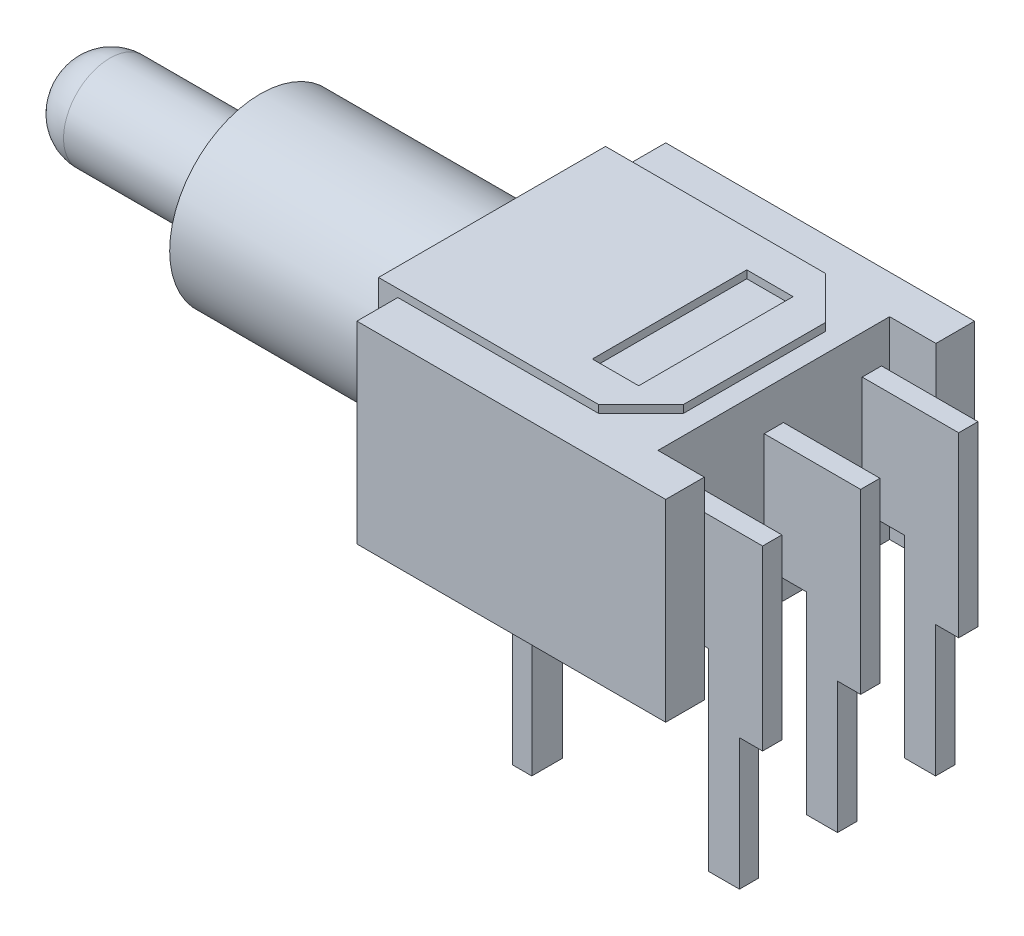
ISO-10303-21;
HEADER;
FILE_DESCRIPTION(('STEP AP214'),'2;1');
FILE_NAME('part.step','',(''),(''),'','','');
FILE_SCHEMA(('AUTOMOTIVE_DESIGN { 1 0 10303 214 1 1 1 1 }'));
ENDSEC;
DATA;
#1=APPLICATION_CONTEXT('core data for automotive mechanical design processes');
#2=APPLICATION_PROTOCOL_DEFINITION('international standard','automotive_design',2000,#1);
#3=PRODUCT_CONTEXT('',#1,'mechanical');
#4=PRODUCT('Part','Part','',(#3));
#5=PRODUCT_RELATED_PRODUCT_CATEGORY('part','',(#4));
#6=PRODUCT_DEFINITION_FORMATION('','',#4);
#7=PRODUCT_DEFINITION_CONTEXT('part definition',#1,'design');
#8=PRODUCT_DEFINITION('design','',#6,#7);
#9=PRODUCT_DEFINITION_SHAPE('','',#8);
#10=(LENGTH_UNIT() NAMED_UNIT(*) SI_UNIT(.MILLI.,.METRE.));
#11=(NAMED_UNIT(*) PLANE_ANGLE_UNIT() SI_UNIT($,.RADIAN.));
#12=(NAMED_UNIT(*) SI_UNIT($,.STERADIAN.) SOLID_ANGLE_UNIT());
#13=UNCERTAINTY_MEASURE_WITH_UNIT(LENGTH_MEASURE(1.E-05),#10,'distance_accuracy_value','');
#14=(GEOMETRIC_REPRESENTATION_CONTEXT(3) GLOBAL_UNCERTAINTY_ASSIGNED_CONTEXT((#13)) GLOBAL_UNIT_ASSIGNED_CONTEXT((#10,
#11,#12)) REPRESENTATION_CONTEXT('',''));
#15=CARTESIAN_POINT('',(0.,0.,0.));
#16=DIRECTION('',(0.,0.,1.));
#17=DIRECTION('',(1.,0.,0.));
#18=AXIS2_PLACEMENT_3D('',#15,#16,#17);
#19=CARTESIAN_POINT('',(0.,5.,-8.));
#20=DIRECTION('',(0.,-1.,0.));
#21=DIRECTION('',(0.,0.,-1.));
#22=AXIS2_PLACEMENT_3D('',#19,#20,#21);
#23=PLANE('',#22);
#24=DIRECTION('',(-1.,0.,0.));
#25=VECTOR('',#24,1.);
#26=CARTESIAN_POINT('',(0.,5.,-6.94));
#27=LINE('',#26,#25);
#28=CARTESIAN_POINT('',(5.2,5.,-6.94));
#29=VERTEX_POINT('',#28);
#30=CARTESIAN_POINT('',(0.,5.,-6.94));
#31=VERTEX_POINT('',#30);
#32=EDGE_CURVE('E554',#29,#31,#27,.T.);
#33=ORIENTED_EDGE('',*,*,#32,.F.);
#34=DIRECTION('',(-0.707106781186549,0.,-0.707106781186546));
#35=VECTOR('',#34,1.);
#36=CARTESIAN_POINT('',(5.2,5.,-6.94));
#37=LINE('',#36,#35);
#38=CARTESIAN_POINT('',(6.3,5.,-5.84));
#39=VERTEX_POINT('',#38);
#40=EDGE_CURVE('E542',#39,#29,#37,.T.);
#41=ORIENTED_EDGE('',*,*,#40,.F.);
#42=DIRECTION('',(0.,0.,-1.));
#43=VECTOR('',#42,1.);
#44=CARTESIAN_POINT('',(6.3,5.,-5.84));
#45=LINE('',#44,#43);
#46=CARTESIAN_POINT('',(6.3,5.,-2.16));
#47=VERTEX_POINT('',#46);
#48=EDGE_CURVE('E547',#47,#39,#45,.T.);
#49=ORIENTED_EDGE('',*,*,#48,.F.);
#50=DIRECTION('',(0.707106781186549,0.,-0.707106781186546));
#51=VECTOR('',#50,1.);
#52=CARTESIAN_POINT('',(5.2,5.,-1.06));
#53=LINE('',#52,#51);
#54=CARTESIAN_POINT('',(5.2,5.,-1.06));
#55=VERTEX_POINT('',#54);
#56=EDGE_CURVE('E560',#55,#47,#53,.T.);
#57=ORIENTED_EDGE('',*,*,#56,.F.);
#58=DIRECTION('',(1.,0.,0.));
#59=VECTOR('',#58,1.);
#60=CARTESIAN_POINT('',(0.,5.,-1.06));
#61=LINE('',#60,#59);
#62=CARTESIAN_POINT('',(0.,5.,-1.06));
#63=VERTEX_POINT('',#62);
#64=EDGE_CURVE('E557',#63,#55,#61,.T.);
#65=ORIENTED_EDGE('',*,*,#64,.F.);
#66=DIRECTION('',(0.,0.,1.));
#67=VECTOR('',#66,1.);
#68=CARTESIAN_POINT('',(0.,5.,0.));
#69=LINE('',#68,#67);
#70=CARTESIAN_POINT('',(0.,5.,0.));
#71=VERTEX_POINT('',#70);
#72=EDGE_CURVE('E768',#63,#71,#69,.T.);
#73=ORIENTED_EDGE('',*,*,#72,.T.);
#74=DIRECTION('',(1.,0.,0.));
#75=VECTOR('',#74,1.);
#76=CARTESIAN_POINT('',(0.,5.,0.));
#77=LINE('',#76,#75);
#78=CARTESIAN_POINT('',(8.,5.,0.));
#79=VERTEX_POINT('',#78);
#80=EDGE_CURVE('E767',#71,#79,#77,.T.);
#81=ORIENTED_EDGE('',*,*,#80,.T.);
#82=DIRECTION('',(0.,0.,-1.));
#83=VECTOR('',#82,1.);
#84=CARTESIAN_POINT('',(8.,5.,0.));
#85=LINE('',#84,#83);
#86=CARTESIAN_POINT('',(8.,5.,-1.));
#87=VERTEX_POINT('',#86);
#88=EDGE_CURVE('E770',#79,#87,#85,.T.);
#89=ORIENTED_EDGE('',*,*,#88,.T.);
#90=DIRECTION('',(-1.,0.,0.));
#91=VECTOR('',#90,1.);
#92=CARTESIAN_POINT('',(8.,5.,-1.));
#93=LINE('',#92,#91);
#94=CARTESIAN_POINT('',(6.8,5.,-1.));
#95=VERTEX_POINT('',#94);
#96=EDGE_CURVE('E772',#87,#95,#93,.T.);
#97=ORIENTED_EDGE('',*,*,#96,.T.);
#98=DIRECTION('',(0.,0.,-1.));
#99=VECTOR('',#98,1.);
#100=CARTESIAN_POINT('',(6.8,5.,-7.));
#101=LINE('',#100,#99);
#102=CARTESIAN_POINT('',(6.8,5.,-7.));
#103=VERTEX_POINT('',#102);
#104=EDGE_CURVE('E774',#95,#103,#101,.T.);
#105=ORIENTED_EDGE('',*,*,#104,.T.);
#106=DIRECTION('',(1.,0.,0.));
#107=VECTOR('',#106,1.);
#108=CARTESIAN_POINT('',(8.,5.,-7.));
#109=LINE('',#108,#107);
#110=CARTESIAN_POINT('',(8.,5.,-7.));
#111=VERTEX_POINT('',#110);
#112=EDGE_CURVE('E776',#103,#111,#109,.T.);
#113=ORIENTED_EDGE('',*,*,#112,.T.);
#114=DIRECTION('',(0.,0.,-1.));
#115=VECTOR('',#114,1.);
#116=CARTESIAN_POINT('',(8.,5.,-7.));
#117=LINE('',#116,#115);
#118=CARTESIAN_POINT('',(8.,5.,-8.));
#119=VERTEX_POINT('',#118);
#120=EDGE_CURVE('E778',#111,#119,#117,.T.);
#121=ORIENTED_EDGE('',*,*,#120,.T.);
#122=DIRECTION('',(-1.,0.,0.));
#123=VECTOR('',#122,1.);
#124=CARTESIAN_POINT('',(0.,5.,-8.));
#125=LINE('',#124,#123);
#126=CARTESIAN_POINT('',(0.,5.,-8.));
#127=VERTEX_POINT('',#126);
#128=EDGE_CURVE('E780',#119,#127,#125,.T.);
#129=ORIENTED_EDGE('',*,*,#128,.T.);
#130=EDGE_CURVE('E764',#127,#31,#69,.T.);
#131=ORIENTED_EDGE('',*,*,#130,.T.);
#132=EDGE_LOOP('',(#33,#41,#49,#57,#65,#73,#81,#89,#97,#105,#113,#121,#129,#131));
#133=FACE_BOUND('',#132,.T.);
#134=ADVANCED_FACE('F34',(#133),#23,.F.);
#135=CARTESIAN_POINT('',(-0.499999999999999,-0.199999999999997,-1.06));
#136=DIRECTION('',(1.,0.,0.));
#137=DIRECTION('',(0.,1.,0.));
#138=AXIS2_PLACEMENT_3D('',#135,#136,#137);
#139=PLANE('',#138);
#140=CARTESIAN_POINT('',(-0.5,2.5,-4.));
#141=DIRECTION('',(-1.,0.,0.));
#142=DIRECTION('',(0.,-1.,0.));
#143=AXIS2_PLACEMENT_3D('',#140,#141,#142);
#144=CIRCLE('',#143,1.85);
#145=CARTESIAN_POINT('',(-0.499999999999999,0.650000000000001,-4.));
#146=VERTEX_POINT('',#145);
#147=EDGE_CURVE('E576',#146,#146,#144,.T.);
#148=ORIENTED_EDGE('',*,*,#147,.T.);
#149=EDGE_LOOP('',(#148));
#150=FACE_BOUND('',#149,.T.);
#151=CARTESIAN_POINT('',(-0.499999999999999,2.5,-4.));
#152=DIRECTION('',(1.,0.,0.));
#153=DIRECTION('',(0.,1.,0.));
#154=AXIS2_PLACEMENT_3D('',#151,#152,#153);
#155=CIRCLE('',#154,1.2);
#156=CARTESIAN_POINT('',(-0.499999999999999,3.7,-4.));
#157=VERTEX_POINT('',#156);
#158=EDGE_CURVE('E832',#157,#157,#155,.F.);
#159=ORIENTED_EDGE('',*,*,#158,.F.);
#160=EDGE_LOOP('',(#159));
#161=FACE_BOUND('',#160,.T.);
#162=ADVANCED_FACE('F853',(#150,#161),#139,.F.);
#163=DIRECTION('',(0.,-1.,0.));
#164=VECTOR('',#163,1.);
#165=CARTESIAN_POINT('',(-0.499999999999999,-0.199999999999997,-6.94));
#166=LINE('',#165,#164);
#167=CARTESIAN_POINT('',(-0.5,5.2,-6.94));
#168=VERTEX_POINT('',#167);
#169=CARTESIAN_POINT('',(-0.499999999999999,-0.199999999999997,-6.94));
#170=VERTEX_POINT('',#169);
#171=EDGE_CURVE('E648',#168,#170,#166,.T.);
#172=ORIENTED_EDGE('',*,*,#171,.T.);
#173=DIRECTION('',(0.,0.,-1.));
#174=VECTOR('',#173,1.);
#175=CARTESIAN_POINT('',(-0.499999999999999,-0.199999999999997,-1.06));
#176=LINE('',#175,#174);
#177=CARTESIAN_POINT('',(-0.499999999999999,-0.199999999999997,-1.06));
#178=VERTEX_POINT('',#177);
#179=EDGE_CURVE('E699',#178,#170,#176,.T.);
#180=ORIENTED_EDGE('',*,*,#179,.F.);
#181=DIRECTION('',(0.,-1.,0.));
#182=VECTOR('',#181,1.);
#183=CARTESIAN_POINT('',(-0.499999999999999,-0.199999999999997,-1.06));
#184=LINE('',#183,#182);
#185=CARTESIAN_POINT('',(-0.5,5.2,-1.06));
#186=VERTEX_POINT('',#185);
#187=EDGE_CURVE('E621',#186,#178,#184,.T.);
#188=ORIENTED_EDGE('',*,*,#187,.F.);
#189=DIRECTION('',(0.,0.,-1.));
#190=VECTOR('',#189,1.);
#191=CARTESIAN_POINT('',(-0.5,5.2,-1.06));
#192=LINE('',#191,#190);
#193=EDGE_CURVE('E702',#186,#168,#192,.T.);
#194=ORIENTED_EDGE('',*,*,#193,.T.);
#195=EDGE_LOOP('',(#172,#180,#188,#194));
#196=FACE_BOUND('',#195,.T.);
#197=CARTESIAN_POINT('',(-0.5,2.5,-4.));
#198=DIRECTION('',(1.,0.,0.));
#199=DIRECTION('',(0.,1.,0.));
#200=AXIS2_PLACEMENT_3D('',#197,#198,#199);
#201=CIRCLE('',#200,2.35);
#202=CARTESIAN_POINT('',(-0.5,4.85,-4.));
#203=VERTEX_POINT('',#202);
#204=EDGE_CURVE('E829',#203,#203,#201,.F.);
#205=ORIENTED_EDGE('',*,*,#204,.F.);
#206=EDGE_LOOP('',(#205));
#207=FACE_BOUND('',#206,.T.);
#208=ADVANCED_FACE('F860',(#196,#207),#139,.F.);
#209=CARTESIAN_POINT('',(2.77,-0.7,-1.06));
#210=DIRECTION('',(0.,0.,-1.));
#211=DIRECTION('',(-1.,0.,0.));
#212=AXIS2_PLACEMENT_3D('',#209,#210,#211);
#213=CYLINDRICAL_SURFACE('',#212,0.2);
#214=DIRECTION('',(0.,0.,-1.));
#215=VECTOR('',#214,1.);
#216=CARTESIAN_POINT('',(2.77,-0.5,-1.06));
#217=LINE('',#216,#215);
#218=CARTESIAN_POINT('',(2.77,-0.5,-1.06));
#219=VERTEX_POINT('',#218);
#220=CARTESIAN_POINT('',(2.77,-0.5,-1.86));
#221=VERTEX_POINT('',#220);
#222=EDGE_CURVE('E693',#219,#221,#217,.T.);
#223=ORIENTED_EDGE('',*,*,#222,.T.);
#224=CARTESIAN_POINT('',(2.77,-0.7,-1.86));
#225=DIRECTION('',(0.,0.,1.));
#226=DIRECTION('',(1.,0.,0.));
#227=AXIS2_PLACEMENT_3D('',#224,#225,#226);
#228=CIRCLE('',#227,0.2);
#229=CARTESIAN_POINT('',(2.97,-0.700000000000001,-1.86));
#230=VERTEX_POINT('',#229);
#231=EDGE_CURVE('E614',#221,#230,#228,.F.);
#232=ORIENTED_EDGE('',*,*,#231,.T.);
#233=DIRECTION('',(0.,0.,-1.));
#234=VECTOR('',#233,1.);
#235=CARTESIAN_POINT('',(2.97,-0.700000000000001,-1.06));
#236=LINE('',#235,#234);
#237=CARTESIAN_POINT('',(2.97,-0.700000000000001,-1.06));
#238=VERTEX_POINT('',#237);
#239=EDGE_CURVE('E689',#238,#230,#236,.T.);
#240=ORIENTED_EDGE('',*,*,#239,.F.);
#241=CARTESIAN_POINT('',(2.77,-0.7,-1.06));
#242=DIRECTION('',(0.,0.,-1.));
#243=DIRECTION('',(1.,0.,0.));
#244=AXIS2_PLACEMENT_3D('',#241,#242,#243);
#245=CIRCLE('',#244,0.2);
#246=EDGE_CURVE('E628',#219,#238,#245,.T.);
#247=ORIENTED_EDGE('',*,*,#246,.F.);
#248=EDGE_LOOP('',(#223,#232,#240,#247));
#249=FACE_BOUND('',#248,.T.);
#250=ADVANCED_FACE('F972',(#249),#213,.F.);
#251=CARTESIAN_POINT('',(2.97,-4.,-1.06));
#252=DIRECTION('',(1.,0.,0.));
#253=DIRECTION('',(0.,1.,0.));
#254=AXIS2_PLACEMENT_3D('',#251,#252,#253);
#255=PLANE('',#254);
#256=ORIENTED_EDGE('',*,*,#239,.T.);
#257=DIRECTION('',(0.,-1.,0.));
#258=VECTOR('',#257,1.);
#259=CARTESIAN_POINT('',(2.97,-4.,-1.86));
#260=LINE('',#259,#258);
#261=CARTESIAN_POINT('',(2.97,-4.,-1.86));
#262=VERTEX_POINT('',#261);
#263=EDGE_CURVE('E611',#230,#262,#260,.T.);
#264=ORIENTED_EDGE('',*,*,#263,.T.);
#265=DIRECTION('',(0.,0.,-1.));
#266=VECTOR('',#265,1.);
#267=CARTESIAN_POINT('',(2.97,-4.,-1.06));
#268=LINE('',#267,#266);
#269=CARTESIAN_POINT('',(2.97,-4.,-1.06));
#270=VERTEX_POINT('',#269);
#271=EDGE_CURVE('E685',#270,#262,#268,.T.);
#272=ORIENTED_EDGE('',*,*,#271,.F.);
#273=DIRECTION('',(0.,-1.,0.));
#274=VECTOR('',#273,1.);
#275=CARTESIAN_POINT('',(2.97,-4.,-1.06));
#276=LINE('',#275,#274);
#277=EDGE_CURVE('E630',#238,#270,#276,.T.);
#278=ORIENTED_EDGE('',*,*,#277,.F.);
#279=EDGE_LOOP('',(#256,#264,#272,#278));
#280=FACE_BOUND('',#279,.T.);
#281=ADVANCED_FACE('F967',(#280),#255,.F.);
#282=CARTESIAN_POINT('',(3.47,-4.,-1.06));
#283=DIRECTION('',(0.,1.,0.));
#284=DIRECTION('',(0.,0.,1.));
#285=AXIS2_PLACEMENT_3D('',#282,#283,#284);
#286=PLANE('',#285);
#287=ORIENTED_EDGE('',*,*,#271,.T.);
#288=DIRECTION('',(1.,0.,0.));
#289=VECTOR('',#288,1.);
#290=CARTESIAN_POINT('',(2.77,-4.,-1.86));
#291=LINE('',#290,#289);
#292=CARTESIAN_POINT('',(3.47,-4.,-1.86));
#293=VERTEX_POINT('',#292);
#294=EDGE_CURVE('E595',#262,#293,#291,.T.);
#295=ORIENTED_EDGE('',*,*,#294,.T.);
#296=DIRECTION('',(0.,0.,-1.));
#297=VECTOR('',#296,1.);
#298=CARTESIAN_POINT('',(3.47,-4.,-1.06));
#299=LINE('',#298,#297);
#300=CARTESIAN_POINT('',(3.47,-4.,-1.06));
#301=VERTEX_POINT('',#300);
#302=EDGE_CURVE('E681',#301,#293,#299,.T.);
#303=ORIENTED_EDGE('',*,*,#302,.F.);
#304=DIRECTION('',(1.,0.,0.));
#305=VECTOR('',#304,1.);
#306=CARTESIAN_POINT('',(3.47,-4.,-1.06));
#307=LINE('',#306,#305);
#308=EDGE_CURVE('E632',#270,#301,#307,.T.);
#309=ORIENTED_EDGE('',*,*,#308,.F.);
#310=EDGE_LOOP('',(#287,#295,#303,#309));
#311=FACE_BOUND('',#310,.T.);
#312=ADVANCED_FACE('F962',(#311),#286,.F.);
#313=CARTESIAN_POINT('',(3.47,-0.700000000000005,-1.06));
#314=DIRECTION('',(-1.,0.,0.));
#315=DIRECTION('',(0.,0.,1.));
#316=AXIS2_PLACEMENT_3D('',#313,#314,#315);
#317=PLANE('',#316);
#318=ORIENTED_EDGE('',*,*,#302,.T.);
#319=DIRECTION('',(0.,-1.,0.));
#320=VECTOR('',#319,1.);
#321=CARTESIAN_POINT('',(3.47,-4.,-1.86));
#322=LINE('',#321,#320);
#323=CARTESIAN_POINT('',(3.47,-0.7,-1.86));
#324=VERTEX_POINT('',#323);
#325=EDGE_CURVE('E585',#324,#293,#322,.T.);
#326=ORIENTED_EDGE('',*,*,#325,.F.);
#327=DIRECTION('',(0.,0.,-1.));
#328=VECTOR('',#327,1.);
#329=CARTESIAN_POINT('',(3.47,-0.700000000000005,-1.06));
#330=LINE('',#329,#328);
#331=CARTESIAN_POINT('',(3.47,-0.700000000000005,-1.06));
#332=VERTEX_POINT('',#331);
#333=EDGE_CURVE('E677',#332,#324,#330,.T.);
#334=ORIENTED_EDGE('',*,*,#333,.F.);
#335=DIRECTION('',(0.,1.,0.));
#336=VECTOR('',#335,1.);
#337=CARTESIAN_POINT('',(3.47,-0.700000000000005,-1.06));
#338=LINE('',#337,#336);
#339=EDGE_CURVE('E634',#301,#332,#338,.T.);
#340=ORIENTED_EDGE('',*,*,#339,.F.);
#341=EDGE_LOOP('',(#318,#326,#334,#340));
#342=FACE_BOUND('',#341,.T.);
#343=ADVANCED_FACE('F957',(#342),#317,.F.);
#344=CARTESIAN_POINT('',(2.77,-0.7,-1.06));
#345=DIRECTION('',(0.,0.,-1.));
#346=DIRECTION('',(-1.,0.,0.));
#347=AXIS2_PLACEMENT_3D('',#344,#345,#346);
#348=CYLINDRICAL_SURFACE('',#347,0.7);
#349=ORIENTED_EDGE('',*,*,#333,.T.);
#350=CARTESIAN_POINT('',(2.77,-0.7,-1.86));
#351=DIRECTION('',(0.,0.,1.));
#352=DIRECTION('',(1.,0.,0.));
#353=AXIS2_PLACEMENT_3D('',#350,#351,#352);
#354=CIRCLE('',#353,0.7);
#355=CARTESIAN_POINT('',(2.77,0.,-1.86));
#356=VERTEX_POINT('',#355);
#357=EDGE_CURVE('E826',#324,#356,#354,.T.);
#358=ORIENTED_EDGE('',*,*,#357,.T.);
#359=DIRECTION('',(0.,0.,-1.));
#360=VECTOR('',#359,1.);
#361=CARTESIAN_POINT('',(2.76999999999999,0.,-1.06));
#362=LINE('',#361,#360);
#363=CARTESIAN_POINT('',(2.77,0.,-1.06));
#364=VERTEX_POINT('',#363);
#365=EDGE_CURVE('E673',#364,#356,#362,.T.);
#366=ORIENTED_EDGE('',*,*,#365,.F.);
#367=CARTESIAN_POINT('',(2.77,-0.7,-1.06));
#368=DIRECTION('',(0.,0.,1.));
#369=DIRECTION('',(-1.,0.,0.));
#370=AXIS2_PLACEMENT_3D('',#367,#368,#369);
#371=CIRCLE('',#370,0.7);
#372=EDGE_CURVE('E636',#332,#364,#371,.T.);
#373=ORIENTED_EDGE('',*,*,#372,.F.);
#374=EDGE_LOOP('',(#349,#358,#366,#373));
#375=FACE_BOUND('',#374,.T.);
#376=ADVANCED_FACE('F952',(#375),#348,.T.);
#377=CARTESIAN_POINT('',(0.,5.,0.));
#378=DIRECTION('',(1.,0.,0.));
#379=DIRECTION('',(0.,0.,-1.));
#380=AXIS2_PLACEMENT_3D('',#377,#378,#379);
#381=PLANE('',#380);
#382=DIRECTION('',(0.,1.,0.));
#383=VECTOR('',#382,1.);
#384=CARTESIAN_POINT('',(0.,5.2,-1.06));
#385=LINE('',#384,#383);
#386=CARTESIAN_POINT('',(0.,0.,-1.06));
#387=VERTEX_POINT('',#386);
#388=EDGE_CURVE('E642',#387,#63,#385,.T.);
#389=ORIENTED_EDGE('',*,*,#388,.F.);
#390=DIRECTION('',(0.,0.,1.));
#391=VECTOR('',#390,1.);
#392=CARTESIAN_POINT('',(0.,0.,0.));
#393=LINE('',#392,#391);
#394=CARTESIAN_POINT('',(0.,0.,0.));
#395=VERTEX_POINT('',#394);
#396=EDGE_CURVE('E763',#387,#395,#393,.T.);
#397=ORIENTED_EDGE('',*,*,#396,.T.);
#398=DIRECTION('',(0.,-1.,0.));
#399=VECTOR('',#398,1.);
#400=CARTESIAN_POINT('',(0.,5.,0.));
#401=LINE('',#400,#399);
#402=EDGE_CURVE('E820',#71,#395,#401,.T.);
#403=ORIENTED_EDGE('',*,*,#402,.F.);
#404=ORIENTED_EDGE('',*,*,#72,.F.);
#405=EDGE_LOOP('',(#389,#397,#403,#404));
#406=FACE_BOUND('',#405,.T.);
#407=ADVANCED_FACE('F1089',(#406),#381,.F.);
#408=CARTESIAN_POINT('',(0.,0.,-8.));
#409=DIRECTION('',(0.,-1.,0.));
#410=DIRECTION('',(0.,0.,-1.));
#411=AXIS2_PLACEMENT_3D('',#408,#409,#410);
#412=PLANE('',#411);
#413=ORIENTED_EDGE('',*,*,#365,.T.);
#414=DIRECTION('',(0.,0.,1.));
#415=VECTOR('',#414,1.);
#416=CARTESIAN_POINT('',(2.77,0.,-1.86));
#417=LINE('',#416,#415);
#418=CARTESIAN_POINT('',(2.76999999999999,0.,-6.14));
#419=VERTEX_POINT('',#418);
#420=EDGE_CURVE('E592',#419,#356,#417,.T.);
#421=ORIENTED_EDGE('',*,*,#420,.F.);
#422=CARTESIAN_POINT('',(2.76999999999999,0.,-6.94));
#423=VERTEX_POINT('',#422);
#424=EDGE_CURVE('E645',#419,#423,#362,.T.);
#425=ORIENTED_EDGE('',*,*,#424,.T.);
#426=DIRECTION('',(-1.,0.,0.));
#427=VECTOR('',#426,1.);
#428=CARTESIAN_POINT('',(0.,0.,-6.94));
#429=LINE('',#428,#427);
#430=CARTESIAN_POINT('',(0.,0.,-6.94));
#431=VERTEX_POINT('',#430);
#432=EDGE_CURVE('E670',#423,#431,#429,.T.);
#433=ORIENTED_EDGE('',*,*,#432,.T.);
#434=CARTESIAN_POINT('',(0.,0.,-8.));
#435=VERTEX_POINT('',#434);
#436=EDGE_CURVE('E783',#435,#431,#393,.T.);
#437=ORIENTED_EDGE('',*,*,#436,.F.);
#438=DIRECTION('',(-1.,0.,0.));
#439=VECTOR('',#438,1.);
#440=CARTESIAN_POINT('',(0.,0.,-8.));
#441=LINE('',#440,#439);
#442=CARTESIAN_POINT('',(8.,0.,-8.));
#443=VERTEX_POINT('',#442);
#444=EDGE_CURVE('E798',#443,#435,#441,.T.);
#445=ORIENTED_EDGE('',*,*,#444,.F.);
#446=DIRECTION('',(0.,0.,-1.));
#447=VECTOR('',#446,1.);
#448=CARTESIAN_POINT('',(8.,0.,-7.));
#449=LINE('',#448,#447);
#450=CARTESIAN_POINT('',(8.,0.,-7.));
#451=VERTEX_POINT('',#450);
#452=EDGE_CURVE('E796',#451,#443,#449,.T.);
#453=ORIENTED_EDGE('',*,*,#452,.F.);
#454=DIRECTION('',(1.,0.,0.));
#455=VECTOR('',#454,1.);
#456=CARTESIAN_POINT('',(8.,0.,-7.));
#457=LINE('',#456,#455);
#458=CARTESIAN_POINT('',(6.8,0.,-7.));
#459=VERTEX_POINT('',#458);
#460=EDGE_CURVE('E794',#459,#451,#457,.T.);
#461=ORIENTED_EDGE('',*,*,#460,.F.);
#462=DIRECTION('',(0.,0.,-1.));
#463=VECTOR('',#462,1.);
#464=CARTESIAN_POINT('',(6.8,0.,-7.));
#465=LINE('',#464,#463);
#466=CARTESIAN_POINT('',(6.8,0.,-1.));
#467=VERTEX_POINT('',#466);
#468=EDGE_CURVE('E792',#467,#459,#465,.T.);
#469=ORIENTED_EDGE('',*,*,#468,.F.);
#470=DIRECTION('',(-1.,0.,0.));
#471=VECTOR('',#470,1.);
#472=CARTESIAN_POINT('',(8.,0.,-1.));
#473=LINE('',#472,#471);
#474=CARTESIAN_POINT('',(8.,0.,-1.));
#475=VERTEX_POINT('',#474);
#476=EDGE_CURVE('E790',#475,#467,#473,.T.);
#477=ORIENTED_EDGE('',*,*,#476,.F.);
#478=DIRECTION('',(0.,0.,-1.));
#479=VECTOR('',#478,1.);
#480=CARTESIAN_POINT('',(8.,0.,0.));
#481=LINE('',#480,#479);
#482=CARTESIAN_POINT('',(8.,0.,0.));
#483=VERTEX_POINT('',#482);
#484=EDGE_CURVE('E788',#483,#475,#481,.T.);
#485=ORIENTED_EDGE('',*,*,#484,.F.);
#486=DIRECTION('',(1.,0.,0.));
#487=VECTOR('',#486,1.);
#488=CARTESIAN_POINT('',(0.,0.,0.));
#489=LINE('',#488,#487);
#490=EDGE_CURVE('E786',#395,#483,#489,.T.);
#491=ORIENTED_EDGE('',*,*,#490,.F.);
#492=ORIENTED_EDGE('',*,*,#396,.F.);
#493=DIRECTION('',(-1.,0.,0.));
#494=VECTOR('',#493,1.);
#495=CARTESIAN_POINT('',(0.,0.,-1.06));
#496=LINE('',#495,#494);
#497=EDGE_CURVE('E639',#364,#387,#496,.T.);
#498=ORIENTED_EDGE('',*,*,#497,.F.);
#499=EDGE_LOOP('',(#413,#421,#425,#433,#437,#445,#453,#461,#469,#477,#485,#491,#492,#498));
#500=FACE_BOUND('',#499,.T.);
#501=ADVANCED_FACE('F1064',(#500),#412,.T.);
#502=ORIENTED_EDGE('',*,*,#436,.T.);
#503=DIRECTION('',(0.,1.,0.));
#504=VECTOR('',#503,1.);
#505=CARTESIAN_POINT('',(0.,5.2,-6.94));
#506=LINE('',#505,#504);
#507=EDGE_CURVE('E622',#431,#31,#506,.T.);
#508=ORIENTED_EDGE('',*,*,#507,.T.);
#509=ORIENTED_EDGE('',*,*,#130,.F.);
#510=DIRECTION('',(0.,-1.,0.));
#511=VECTOR('',#510,1.);
#512=CARTESIAN_POINT('',(0.,5.,-8.));
#513=LINE('',#512,#511);
#514=EDGE_CURVE('E782',#127,#435,#513,.T.);
#515=ORIENTED_EDGE('',*,*,#514,.T.);
#516=EDGE_LOOP('',(#502,#508,#509,#515));
#517=FACE_BOUND('',#516,.T.);
#518=ADVANCED_FACE('F1106',(#517),#381,.F.);
#519=CARTESIAN_POINT('',(0.,5.,0.));
#520=DIRECTION('',(0.,0.,-1.));
#521=DIRECTION('',(-1.,0.,0.));
#522=AXIS2_PLACEMENT_3D('',#519,#520,#521);
#523=PLANE('',#522);
#524=ORIENTED_EDGE('',*,*,#490,.T.);
#525=DIRECTION('',(0.,-1.,0.));
#526=VECTOR('',#525,1.);
#527=CARTESIAN_POINT('',(8.,5.,0.));
#528=LINE('',#527,#526);
#529=EDGE_CURVE('E817',#79,#483,#528,.T.);
#530=ORIENTED_EDGE('',*,*,#529,.F.);
#531=ORIENTED_EDGE('',*,*,#80,.F.);
#532=ORIENTED_EDGE('',*,*,#402,.T.);
#533=EDGE_LOOP('',(#524,#530,#531,#532));
#534=FACE_BOUND('',#533,.T.);
#535=ADVANCED_FACE('F1085',(#534),#523,.F.);
#536=CARTESIAN_POINT('',(8.,5.,0.));
#537=DIRECTION('',(-1.,0.,0.));
#538=DIRECTION('',(0.,0.,1.));
#539=AXIS2_PLACEMENT_3D('',#536,#537,#538);
#540=PLANE('',#539);
#541=ORIENTED_EDGE('',*,*,#484,.T.);
#542=DIRECTION('',(0.,-1.,0.));
#543=VECTOR('',#542,1.);
#544=CARTESIAN_POINT('',(8.,5.,-1.));
#545=LINE('',#544,#543);
#546=EDGE_CURVE('E814',#87,#475,#545,.T.);
#547=ORIENTED_EDGE('',*,*,#546,.F.);
#548=ORIENTED_EDGE('',*,*,#88,.F.);
#549=ORIENTED_EDGE('',*,*,#529,.T.);
#550=EDGE_LOOP('',(#541,#547,#548,#549));
#551=FACE_BOUND('',#550,.T.);
#552=ADVANCED_FACE('F1081',(#551),#540,.F.);
#553=CARTESIAN_POINT('',(8.,5.,-1.));
#554=DIRECTION('',(0.,0.,1.));
#555=DIRECTION('',(1.,0.,0.));
#556=AXIS2_PLACEMENT_3D('',#553,#554,#555);
#557=PLANE('',#556);
#558=ORIENTED_EDGE('',*,*,#476,.T.);
#559=DIRECTION('',(0.,-1.,0.));
#560=VECTOR('',#559,1.);
#561=CARTESIAN_POINT('',(6.8,5.,-1.));
#562=LINE('',#561,#560);
#563=EDGE_CURVE('E811',#95,#467,#562,.T.);
#564=ORIENTED_EDGE('',*,*,#563,.F.);
#565=ORIENTED_EDGE('',*,*,#96,.F.);
#566=ORIENTED_EDGE('',*,*,#546,.T.);
#567=EDGE_LOOP('',(#558,#564,#565,#566));
#568=FACE_BOUND('',#567,.T.);
#569=ADVANCED_FACE('F1051',(#568),#557,.F.);
#570=CARTESIAN_POINT('',(6.8,5.,-7.));
#571=DIRECTION('',(-1.,0.,0.));
#572=DIRECTION('',(0.,0.,1.));
#573=AXIS2_PLACEMENT_3D('',#570,#571,#572);
#574=PLANE('',#573);
#575=DIRECTION('',(0.,0.,-1.));
#576=VECTOR('',#575,1.);
#577=CARTESIAN_POINT('',(6.8,0.999999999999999,-1.21));
#578=LINE('',#577,#576);
#579=CARTESIAN_POINT('',(6.8,0.999999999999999,-1.21));
#580=VERTEX_POINT('',#579);
#581=CARTESIAN_POINT('',(6.8,1.,-1.71));
#582=VERTEX_POINT('',#581);
#583=EDGE_CURVE('E54',#580,#582,#578,.T.);
#584=ORIENTED_EDGE('',*,*,#583,.F.);
#585=DIRECTION('',(0.,-1.,0.));
#586=VECTOR('',#585,1.);
#587=CARTESIAN_POINT('',(6.8,4.,-1.21));
#588=LINE('',#587,#586);
#589=CARTESIAN_POINT('',(6.8,4.,-1.21));
#590=VERTEX_POINT('',#589);
#591=EDGE_CURVE('E49',#590,#580,#588,.T.);
#592=ORIENTED_EDGE('',*,*,#591,.F.);
#593=DIRECTION('',(0.,0.,-1.));
#594=VECTOR('',#593,1.);
#595=CARTESIAN_POINT('',(6.8,4.,-1.21));
#596=LINE('',#595,#594);
#597=CARTESIAN_POINT('',(6.8,4.,-1.71));
#598=VERTEX_POINT('',#597);
#599=EDGE_CURVE('E452',#590,#598,#596,.T.);
#600=ORIENTED_EDGE('',*,*,#599,.T.);
#601=DIRECTION('',(0.,-1.,0.));
#602=VECTOR('',#601,1.);
#603=CARTESIAN_POINT('',(6.8,4.,-1.71));
#604=LINE('',#603,#602);
#605=EDGE_CURVE('E425',#598,#582,#604,.T.);
#606=ORIENTED_EDGE('',*,*,#605,.T.);
#607=EDGE_LOOP('',(#584,#592,#600,#606));
#608=FACE_BOUND('',#607,.T.);
#609=DIRECTION('',(0.,0.,-1.));
#610=VECTOR('',#609,1.);
#611=CARTESIAN_POINT('',(6.8,0.999999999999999,-6.29));
#612=LINE('',#611,#610);
#613=CARTESIAN_POINT('',(6.8,0.999999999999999,-6.29));
#614=VERTEX_POINT('',#613);
#615=CARTESIAN_POINT('',(6.8,1.,-6.79));
#616=VERTEX_POINT('',#615);
#617=EDGE_CURVE('E507',#614,#616,#612,.T.);
#618=ORIENTED_EDGE('',*,*,#617,.F.);
#619=DIRECTION('',(0.,-1.,0.));
#620=VECTOR('',#619,1.);
#621=CARTESIAN_POINT('',(6.8,4.,-6.29));
#622=LINE('',#621,#620);
#623=CARTESIAN_POINT('',(6.8,4.,-6.29));
#624=VERTEX_POINT('',#623);
#625=EDGE_CURVE('E458',#624,#614,#622,.T.);
#626=ORIENTED_EDGE('',*,*,#625,.F.);
#627=DIRECTION('',(0.,0.,-1.));
#628=VECTOR('',#627,1.);
#629=CARTESIAN_POINT('',(6.8,4.,-6.29));
#630=LINE('',#629,#628);
#631=CARTESIAN_POINT('',(6.8,4.,-6.79));
#632=VERTEX_POINT('',#631);
#633=EDGE_CURVE('E510',#624,#632,#630,.T.);
#634=ORIENTED_EDGE('',*,*,#633,.T.);
#635=DIRECTION('',(0.,-1.,0.));
#636=VECTOR('',#635,1.);
#637=CARTESIAN_POINT('',(6.8,4.,-6.79));
#638=LINE('',#637,#636);
#639=EDGE_CURVE('E477',#632,#616,#638,.T.);
#640=ORIENTED_EDGE('',*,*,#639,.T.);
#641=EDGE_LOOP('',(#618,#626,#634,#640));
#642=FACE_BOUND('',#641,.T.);
#643=DIRECTION('',(0.,0.,-1.));
#644=VECTOR('',#643,1.);
#645=CARTESIAN_POINT('',(6.8,0.999999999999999,-3.75));
#646=LINE('',#645,#644);
#647=CARTESIAN_POINT('',(6.8,0.999999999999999,-3.75));
#648=VERTEX_POINT('',#647);
#649=CARTESIAN_POINT('',(6.8,1.,-4.25));
#650=VERTEX_POINT('',#649);
#651=EDGE_CURVE('E758',#648,#650,#646,.T.);
#652=ORIENTED_EDGE('',*,*,#651,.F.);
#653=DIRECTION('',(0.,-1.,0.));
#654=VECTOR('',#653,1.);
#655=CARTESIAN_POINT('',(6.8,4.,-3.75));
#656=LINE('',#655,#654);
#657=CARTESIAN_POINT('',(6.8,4.,-3.75));
#658=VERTEX_POINT('',#657);
#659=EDGE_CURVE('E709',#658,#648,#656,.T.);
#660=ORIENTED_EDGE('',*,*,#659,.F.);
#661=DIRECTION('',(0.,0.,-1.));
#662=VECTOR('',#661,1.);
#663=CARTESIAN_POINT('',(6.8,4.,-3.75));
#664=LINE('',#663,#662);
#665=CARTESIAN_POINT('',(6.8,4.,-4.25));
#666=VERTEX_POINT('',#665);
#667=EDGE_CURVE('E761',#658,#666,#664,.T.);
#668=ORIENTED_EDGE('',*,*,#667,.T.);
#669=DIRECTION('',(0.,-1.,0.));
#670=VECTOR('',#669,1.);
#671=CARTESIAN_POINT('',(6.8,4.,-4.25));
#672=LINE('',#671,#670);
#673=EDGE_CURVE('E728',#666,#650,#672,.T.);
#674=ORIENTED_EDGE('',*,*,#673,.T.);
#675=EDGE_LOOP('',(#652,#660,#668,#674));
#676=FACE_BOUND('',#675,.T.);
#677=ORIENTED_EDGE('',*,*,#468,.T.);
#678=DIRECTION('',(0.,-1.,0.));
#679=VECTOR('',#678,1.);
#680=CARTESIAN_POINT('',(6.8,5.,-7.));
#681=LINE('',#680,#679);
#682=EDGE_CURVE('E808',#103,#459,#681,.T.);
#683=ORIENTED_EDGE('',*,*,#682,.F.);
#684=ORIENTED_EDGE('',*,*,#104,.F.);
#685=ORIENTED_EDGE('',*,*,#563,.T.);
#686=EDGE_LOOP('',(#677,#683,#684,#685));
#687=FACE_BOUND('',#686,.T.);
#688=ADVANCED_FACE('F1034',(#608,#642,#676,#687),#574,.F.);
#689=CARTESIAN_POINT('',(8.,5.,-7.));
#690=DIRECTION('',(0.,0.,-1.));
#691=DIRECTION('',(-1.,0.,0.));
#692=AXIS2_PLACEMENT_3D('',#689,#690,#691);
#693=PLANE('',#692);
#694=ORIENTED_EDGE('',*,*,#460,.T.);
#695=DIRECTION('',(0.,-1.,0.));
#696=VECTOR('',#695,1.);
#697=CARTESIAN_POINT('',(8.,5.,-7.));
#698=LINE('',#697,#696);
#699=EDGE_CURVE('E805',#111,#451,#698,.T.);
#700=ORIENTED_EDGE('',*,*,#699,.F.);
#701=ORIENTED_EDGE('',*,*,#112,.F.);
#702=ORIENTED_EDGE('',*,*,#682,.T.);
#703=EDGE_LOOP('',(#694,#700,#701,#702));
#704=FACE_BOUND('',#703,.T.);
#705=ADVANCED_FACE('F1050',(#704),#693,.F.);
#706=CARTESIAN_POINT('',(8.,5.,-7.));
#707=DIRECTION('',(-1.,0.,0.));
#708=DIRECTION('',(0.,0.,1.));
#709=AXIS2_PLACEMENT_3D('',#706,#707,#708);
#710=PLANE('',#709);
#711=ORIENTED_EDGE('',*,*,#452,.T.);
#712=DIRECTION('',(0.,-1.,0.));
#713=VECTOR('',#712,1.);
#714=CARTESIAN_POINT('',(8.,5.,-8.));
#715=LINE('',#714,#713);
#716=EDGE_CURVE('E802',#119,#443,#715,.T.);
#717=ORIENTED_EDGE('',*,*,#716,.F.);
#718=ORIENTED_EDGE('',*,*,#120,.F.);
#719=ORIENTED_EDGE('',*,*,#699,.T.);
#720=EDGE_LOOP('',(#711,#717,#718,#719));
#721=FACE_BOUND('',#720,.T.);
#722=ADVANCED_FACE('F1021',(#721),#710,.F.);
#723=CARTESIAN_POINT('',(0.,5.,-8.));
#724=DIRECTION('',(0.,0.,1.));
#725=DIRECTION('',(1.,0.,0.));
#726=AXIS2_PLACEMENT_3D('',#723,#724,#725);
#727=PLANE('',#726);
#728=ORIENTED_EDGE('',*,*,#444,.T.);
#729=ORIENTED_EDGE('',*,*,#514,.F.);
#730=ORIENTED_EDGE('',*,*,#128,.F.);
#731=ORIENTED_EDGE('',*,*,#716,.T.);
#732=EDGE_LOOP('',(#728,#729,#730,#731));
#733=FACE_BOUND('',#732,.T.);
#734=ADVANCED_FACE('F1016',(#733),#727,.F.);
#735=CARTESIAN_POINT('',(9.3,4.,-3.75));
#736=DIRECTION('',(0.,-1.,0.));
#737=DIRECTION('',(1.,0.,0.));
#738=AXIS2_PLACEMENT_3D('',#735,#736,#737);
#739=PLANE('',#738);
#740=DIRECTION('',(-1.,0.,0.));
#741=VECTOR('',#740,1.);
#742=CARTESIAN_POINT('',(9.3,4.,-4.25));
#743=LINE('',#742,#741);
#744=CARTESIAN_POINT('',(9.3,4.,-4.25));
#745=VERTEX_POINT('',#744);
#746=EDGE_CURVE('E705',#745,#666,#743,.T.);
#747=ORIENTED_EDGE('',*,*,#746,.T.);
#748=ORIENTED_EDGE('',*,*,#667,.F.);
#749=DIRECTION('',(-1.,0.,0.));
#750=VECTOR('',#749,1.);
#751=CARTESIAN_POINT('',(9.3,4.,-3.75));
#752=LINE('',#751,#750);
#753=CARTESIAN_POINT('',(9.3,4.,-3.75));
#754=VERTEX_POINT('',#753);
#755=EDGE_CURVE('E706',#754,#658,#752,.T.);
#756=ORIENTED_EDGE('',*,*,#755,.F.);
#757=DIRECTION('',(0.,0.,-1.));
#758=VECTOR('',#757,1.);
#759=CARTESIAN_POINT('',(9.3,4.,-3.75));
#760=LINE('',#759,#758);
#761=EDGE_CURVE('E725',#754,#745,#760,.T.);
#762=ORIENTED_EDGE('',*,*,#761,.T.);
#763=EDGE_LOOP('',(#747,#748,#756,#762));
#764=FACE_BOUND('',#763,.T.);
#765=ADVANCED_FACE('F1013',(#764),#739,.F.);
#766=CARTESIAN_POINT('',(6.8,0.999999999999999,-3.75));
#767=DIRECTION('',(0.,1.,0.));
#768=DIRECTION('',(-1.,0.,0.));
#769=AXIS2_PLACEMENT_3D('',#766,#767,#768);
#770=PLANE('',#769);
#771=DIRECTION('',(1.,0.,0.));
#772=VECTOR('',#771,1.);
#773=CARTESIAN_POINT('',(6.8,0.999999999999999,-4.25));
#774=LINE('',#773,#772);
#775=CARTESIAN_POINT('',(7.9,1.,-4.25));
#776=VERTEX_POINT('',#775);
#777=EDGE_CURVE('E730',#650,#776,#774,.T.);
#778=ORIENTED_EDGE('',*,*,#777,.T.);
#779=DIRECTION('',(0.,0.,-1.));
#780=VECTOR('',#779,1.);
#781=CARTESIAN_POINT('',(7.9,1.,-3.75));
#782=LINE('',#781,#780);
#783=CARTESIAN_POINT('',(7.9,1.,-3.75));
#784=VERTEX_POINT('',#783);
#785=EDGE_CURVE('E755',#784,#776,#782,.T.);
#786=ORIENTED_EDGE('',*,*,#785,.F.);
#787=DIRECTION('',(1.,0.,0.));
#788=VECTOR('',#787,1.);
#789=CARTESIAN_POINT('',(6.8,0.999999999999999,-3.75));
#790=LINE('',#789,#788);
#791=EDGE_CURVE('E713',#648,#784,#790,.T.);
#792=ORIENTED_EDGE('',*,*,#791,.F.);
#793=ORIENTED_EDGE('',*,*,#651,.T.);
#794=EDGE_LOOP('',(#778,#786,#792,#793));
#795=FACE_BOUND('',#794,.T.);
#796=ADVANCED_FACE('F1010',(#795),#770,.F.);
#797=CARTESIAN_POINT('',(7.9,1.,-3.75));
#798=DIRECTION('',(1.,0.,0.));
#799=DIRECTION('',(0.,0.,-1.));
#800=AXIS2_PLACEMENT_3D('',#797,#798,#799);
#801=PLANE('',#800);
#802=DIRECTION('',(0.,-1.,0.));
#803=VECTOR('',#802,1.);
#804=CARTESIAN_POINT('',(7.9,1.,-4.25));
#805=LINE('',#804,#803);
#806=CARTESIAN_POINT('',(7.9,-4.,-4.25));
#807=VERTEX_POINT('',#806);
#808=EDGE_CURVE('E732',#776,#807,#805,.T.);
#809=ORIENTED_EDGE('',*,*,#808,.T.);
#810=DIRECTION('',(0.,0.,-1.));
#811=VECTOR('',#810,1.);
#812=CARTESIAN_POINT('',(7.9,-4.,-3.75));
#813=LINE('',#812,#811);
#814=CARTESIAN_POINT('',(7.9,-4.,-3.75));
#815=VERTEX_POINT('',#814);
#816=EDGE_CURVE('E752',#815,#807,#813,.T.);
#817=ORIENTED_EDGE('',*,*,#816,.F.);
#818=DIRECTION('',(0.,-1.,0.));
#819=VECTOR('',#818,1.);
#820=CARTESIAN_POINT('',(7.9,1.,-3.75));
#821=LINE('',#820,#819);
#822=EDGE_CURVE('E715',#784,#815,#821,.T.);
#823=ORIENTED_EDGE('',*,*,#822,.F.);
#824=ORIENTED_EDGE('',*,*,#785,.T.);
#825=EDGE_LOOP('',(#809,#817,#823,#824));
#826=FACE_BOUND('',#825,.T.);
#827=ADVANCED_FACE('F1006',(#826),#801,.F.);
#828=CARTESIAN_POINT('',(7.9,-4.,-3.75));
#829=DIRECTION('',(0.,1.,0.));
#830=DIRECTION('',(-1.,0.,0.));
#831=AXIS2_PLACEMENT_3D('',#828,#829,#830);
#832=PLANE('',#831);
#833=DIRECTION('',(1.,0.,0.));
#834=VECTOR('',#833,1.);
#835=CARTESIAN_POINT('',(7.9,-4.,-4.25));
#836=LINE('',#835,#834);
#837=CARTESIAN_POINT('',(8.7,-4.,-4.25));
#838=VERTEX_POINT('',#837);
#839=EDGE_CURVE('E734',#807,#838,#836,.T.);
#840=ORIENTED_EDGE('',*,*,#839,.T.);
#841=DIRECTION('',(0.,0.,-1.));
#842=VECTOR('',#841,1.);
#843=CARTESIAN_POINT('',(8.7,-4.,-3.75));
#844=LINE('',#843,#842);
#845=CARTESIAN_POINT('',(8.7,-4.,-3.75));
#846=VERTEX_POINT('',#845);
#847=EDGE_CURVE('E749',#846,#838,#844,.T.);
#848=ORIENTED_EDGE('',*,*,#847,.F.);
#849=DIRECTION('',(1.,0.,0.));
#850=VECTOR('',#849,1.);
#851=CARTESIAN_POINT('',(7.9,-4.,-3.75));
#852=LINE('',#851,#850);
#853=EDGE_CURVE('E717',#815,#846,#852,.T.);
#854=ORIENTED_EDGE('',*,*,#853,.F.);
#855=ORIENTED_EDGE('',*,*,#816,.T.);
#856=EDGE_LOOP('',(#840,#848,#854,#855));
#857=FACE_BOUND('',#856,.T.);
#858=ADVANCED_FACE('F1002',(#857),#832,.F.);
#859=CARTESIAN_POINT('',(8.7,-4.,-3.75));
#860=DIRECTION('',(-1.,0.,0.));
#861=DIRECTION('',(0.,0.,1.));
#862=AXIS2_PLACEMENT_3D('',#859,#860,#861);
#863=PLANE('',#862);
#864=DIRECTION('',(0.,1.,0.));
#865=VECTOR('',#864,1.);
#866=CARTESIAN_POINT('',(8.7,-4.,-4.25));
#867=LINE('',#866,#865);
#868=CARTESIAN_POINT('',(8.7,-0.6,-4.25));
#869=VERTEX_POINT('',#868);
#870=EDGE_CURVE('E736',#838,#869,#867,.T.);
#871=ORIENTED_EDGE('',*,*,#870,.T.);
#872=DIRECTION('',(0.,0.,-1.));
#873=VECTOR('',#872,1.);
#874=CARTESIAN_POINT('',(8.7,-0.6,-3.75));
#875=LINE('',#874,#873);
#876=CARTESIAN_POINT('',(8.7,-0.6,-3.75));
#877=VERTEX_POINT('',#876);
#878=EDGE_CURVE('E746',#877,#869,#875,.T.);
#879=ORIENTED_EDGE('',*,*,#878,.F.);
#880=DIRECTION('',(0.,1.,0.));
#881=VECTOR('',#880,1.);
#882=CARTESIAN_POINT('',(8.7,-4.,-3.75));
#883=LINE('',#882,#881);
#884=EDGE_CURVE('E719',#846,#877,#883,.T.);
#885=ORIENTED_EDGE('',*,*,#884,.F.);
#886=ORIENTED_EDGE('',*,*,#847,.T.);
#887=EDGE_LOOP('',(#871,#879,#885,#886));
#888=FACE_BOUND('',#887,.T.);
#889=ADVANCED_FACE('F998',(#888),#863,.F.);
#890=CARTESIAN_POINT('',(8.7,-0.6,-3.75));
#891=DIRECTION('',(0.,1.,0.));
#892=DIRECTION('',(-1.,0.,0.));
#893=AXIS2_PLACEMENT_3D('',#890,#891,#892);
#894=PLANE('',#893);
#895=DIRECTION('',(1.,0.,0.));
#896=VECTOR('',#895,1.);
#897=CARTESIAN_POINT('',(8.7,-0.6,-4.25));
#898=LINE('',#897,#896);
#899=CARTESIAN_POINT('',(9.3,-0.6,-4.25));
#900=VERTEX_POINT('',#899);
#901=EDGE_CURVE('E738',#869,#900,#898,.T.);
#902=ORIENTED_EDGE('',*,*,#901,.T.);
#903=DIRECTION('',(0.,0.,-1.));
#904=VECTOR('',#903,1.);
#905=CARTESIAN_POINT('',(9.3,-0.6,-3.75));
#906=LINE('',#905,#904);
#907=CARTESIAN_POINT('',(9.3,-0.6,-3.75));
#908=VERTEX_POINT('',#907);
#909=EDGE_CURVE('E743',#908,#900,#906,.T.);
#910=ORIENTED_EDGE('',*,*,#909,.F.);
#911=DIRECTION('',(1.,0.,0.));
#912=VECTOR('',#911,1.);
#913=CARTESIAN_POINT('',(8.7,-0.6,-3.75));
#914=LINE('',#913,#912);
#915=EDGE_CURVE('E721',#877,#908,#914,.T.);
#916=ORIENTED_EDGE('',*,*,#915,.F.);
#917=ORIENTED_EDGE('',*,*,#878,.T.);
#918=EDGE_LOOP('',(#902,#910,#916,#917));
#919=FACE_BOUND('',#918,.T.);
#920=ADVANCED_FACE('F994',(#919),#894,.F.);
#921=CARTESIAN_POINT('',(9.3,-0.6,-3.75));
#922=DIRECTION('',(-1.,0.,0.));
#923=DIRECTION('',(0.,-1.,0.));
#924=AXIS2_PLACEMENT_3D('',#921,#922,#923);
#925=PLANE('',#924);
#926=DIRECTION('',(0.,1.,0.));
#927=VECTOR('',#926,1.);
#928=CARTESIAN_POINT('',(9.3,-0.6,-4.25));
#929=LINE('',#928,#927);
#930=EDGE_CURVE('E710',#900,#745,#929,.T.);
#931=ORIENTED_EDGE('',*,*,#930,.T.);
#932=ORIENTED_EDGE('',*,*,#761,.F.);
#933=DIRECTION('',(0.,1.,0.));
#934=VECTOR('',#933,1.);
#935=CARTESIAN_POINT('',(9.3,-0.6,-3.75));
#936=LINE('',#935,#934);
#937=EDGE_CURVE('E723',#908,#754,#936,.T.);
#938=ORIENTED_EDGE('',*,*,#937,.F.);
#939=ORIENTED_EDGE('',*,*,#909,.T.);
#940=EDGE_LOOP('',(#931,#932,#938,#939));
#941=FACE_BOUND('',#940,.T.);
#942=ADVANCED_FACE('F987',(#941),#925,.F.);
#943=CARTESIAN_POINT('',(6.8,4.,-3.75));
#944=DIRECTION('',(0.,0.,1.));
#945=DIRECTION('',(1.,0.,0.));
#946=AXIS2_PLACEMENT_3D('',#943,#944,#945);
#947=PLANE('',#946);
#948=ORIENTED_EDGE('',*,*,#755,.T.);
#949=ORIENTED_EDGE('',*,*,#659,.T.);
#950=ORIENTED_EDGE('',*,*,#791,.T.);
#951=ORIENTED_EDGE('',*,*,#822,.T.);
#952=ORIENTED_EDGE('',*,*,#853,.T.);
#953=ORIENTED_EDGE('',*,*,#884,.T.);
#954=ORIENTED_EDGE('',*,*,#915,.T.);
#955=ORIENTED_EDGE('',*,*,#937,.T.);
#956=EDGE_LOOP('',(#948,#949,#950,#951,#952,#953,#954,#955));
#957=FACE_BOUND('',#956,.T.);
#958=ADVANCED_FACE('F984',(#957),#947,.T.);
#959=CARTESIAN_POINT('',(6.8,4.,-4.25));
#960=DIRECTION('',(0.,0.,1.));
#961=DIRECTION('',(1.,0.,0.));
#962=AXIS2_PLACEMENT_3D('',#959,#960,#961);
#963=PLANE('',#962);
#964=ORIENTED_EDGE('',*,*,#746,.F.);
#965=ORIENTED_EDGE('',*,*,#930,.F.);
#966=ORIENTED_EDGE('',*,*,#901,.F.);
#967=ORIENTED_EDGE('',*,*,#870,.F.);
#968=ORIENTED_EDGE('',*,*,#839,.F.);
#969=ORIENTED_EDGE('',*,*,#808,.F.);
#970=ORIENTED_EDGE('',*,*,#777,.F.);
#971=ORIENTED_EDGE('',*,*,#673,.F.);
#972=EDGE_LOOP('',(#964,#965,#966,#967,#968,#969,#970,#971));
#973=FACE_BOUND('',#972,.T.);
#974=ADVANCED_FACE('F982',(#973),#963,.F.);
#975=CARTESIAN_POINT('',(-0.5,5.2,-1.06));
#976=DIRECTION('',(0.,-1.,0.));
#977=DIRECTION('',(0.,0.,-1.));
#978=AXIS2_PLACEMENT_3D('',#975,#976,#977);
#979=PLANE('',#978);
#980=DIRECTION('',(-1.,0.,0.));
#981=VECTOR('',#980,1.);
#982=CARTESIAN_POINT('',(-0.5,5.2,-6.94));
#983=LINE('',#982,#981);
#984=CARTESIAN_POINT('',(5.2,5.2,-6.94));
#985=VERTEX_POINT('',#984);
#986=EDGE_CURVE('E617',#985,#168,#983,.T.);
#987=ORIENTED_EDGE('',*,*,#986,.T.);
#988=ORIENTED_EDGE('',*,*,#193,.F.);
#989=DIRECTION('',(-1.,0.,0.));
#990=VECTOR('',#989,1.);
#991=CARTESIAN_POINT('',(-0.5,5.2,-1.06));
#992=LINE('',#991,#990);
#993=CARTESIAN_POINT('',(5.2,5.2,-1.06));
#994=VERTEX_POINT('',#993);
#995=EDGE_CURVE('E618',#994,#186,#992,.T.);
#996=ORIENTED_EDGE('',*,*,#995,.F.);
#997=DIRECTION('',(0.707106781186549,0.,-0.707106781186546));
#998=VECTOR('',#997,1.);
#999=CARTESIAN_POINT('',(5.2,5.2,-1.06));
#1000=LINE('',#999,#998);
#1001=CARTESIAN_POINT('',(6.3,5.2,-2.16));
#1002=VERTEX_POINT('',#1001);
#1003=EDGE_CURVE('E546',#994,#1002,#1000,.T.);
#1004=ORIENTED_EDGE('',*,*,#1003,.T.);
#1005=DIRECTION('',(0.,0.,-1.));
#1006=VECTOR('',#1005,1.);
#1007=CARTESIAN_POINT('',(6.3,5.2,-5.84));
#1008=LINE('',#1007,#1006);
#1009=CARTESIAN_POINT('',(6.3,5.2,-5.84));
#1010=VERTEX_POINT('',#1009);
#1011=EDGE_CURVE('E549',#1002,#1010,#1008,.T.);
#1012=ORIENTED_EDGE('',*,*,#1011,.T.);
#1013=DIRECTION('',(-0.707106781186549,0.,-0.707106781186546));
#1014=VECTOR('',#1013,1.);
#1015=CARTESIAN_POINT('',(5.2,5.2,-6.94));
#1016=LINE('',#1015,#1014);
#1017=EDGE_CURVE('E543',#1010,#985,#1016,.T.);
#1018=ORIENTED_EDGE('',*,*,#1017,.T.);
#1019=EDGE_LOOP('',(#987,#988,#996,#1004,#1012,#1018));
#1020=FACE_BOUND('',#1019,.T.);
#1021=DIRECTION('',(-1.,0.,0.));
#1022=VECTOR('',#1021,1.);
#1023=CARTESIAN_POINT('',(4.1,5.2,-6.));
#1024=LINE('',#1023,#1022);
#1025=CARTESIAN_POINT('',(5.3,5.2,-6.));
#1026=VERTEX_POINT('',#1025);
#1027=CARTESIAN_POINT('',(4.1,5.2,-6.));
#1028=VERTEX_POINT('',#1027);
#1029=EDGE_CURVE('E515',#1026,#1028,#1024,.T.);
#1030=ORIENTED_EDGE('',*,*,#1029,.F.);
#1031=DIRECTION('',(0.,0.,-1.));
#1032=VECTOR('',#1031,1.);
#1033=CARTESIAN_POINT('',(5.3,5.2,-6.));
#1034=LINE('',#1033,#1032);
#1035=CARTESIAN_POINT('',(5.3,5.2,-2.));
#1036=VERTEX_POINT('',#1035);
#1037=EDGE_CURVE('E513',#1036,#1026,#1034,.T.);
#1038=ORIENTED_EDGE('',*,*,#1037,.F.);
#1039=DIRECTION('',(1.,0.,0.));
#1040=VECTOR('',#1039,1.);
#1041=CARTESIAN_POINT('',(4.1,5.2,-2.));
#1042=LINE('',#1041,#1040);
#1043=CARTESIAN_POINT('',(4.1,5.2,-2.));
#1044=VERTEX_POINT('',#1043);
#1045=EDGE_CURVE('E521',#1044,#1036,#1042,.T.);
#1046=ORIENTED_EDGE('',*,*,#1045,.F.);
#1047=DIRECTION('',(0.,0.,1.));
#1048=VECTOR('',#1047,1.);
#1049=CARTESIAN_POINT('',(4.1,5.2,-6.));
#1050=LINE('',#1049,#1048);
#1051=EDGE_CURVE('E518',#1028,#1044,#1050,.T.);
#1052=ORIENTED_EDGE('',*,*,#1051,.F.);
#1053=EDGE_LOOP('',(#1030,#1038,#1046,#1052));
#1054=FACE_BOUND('',#1053,.T.);
#1055=ADVANCED_FACE('F894',(#1020,#1054),#979,.F.);
#1056=CARTESIAN_POINT('',(-0.199999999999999,-0.199999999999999,-1.06));
#1057=DIRECTION('',(0.,0.,-1.));
#1058=DIRECTION('',(-1.,0.,0.));
#1059=AXIS2_PLACEMENT_3D('',#1056,#1057,#1058);
#1060=CYLINDRICAL_SURFACE('',#1059,0.3);
#1061=CARTESIAN_POINT('',(-0.199999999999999,-0.199999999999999,-6.94));
#1062=DIRECTION('',(0.,0.,1.));
#1063=DIRECTION('',(-1.,0.,0.));
#1064=AXIS2_PLACEMENT_3D('',#1061,#1062,#1063);
#1065=CIRCLE('',#1064,0.3);
#1066=CARTESIAN_POINT('',(-0.199999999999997,-0.499999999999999,-6.94));
#1067=VERTEX_POINT('',#1066);
#1068=EDGE_CURVE('E650',#170,#1067,#1065,.T.);
#1069=ORIENTED_EDGE('',*,*,#1068,.T.);
#1070=DIRECTION('',(0.,0.,-1.));
#1071=VECTOR('',#1070,1.);
#1072=CARTESIAN_POINT('',(-0.199999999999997,-0.499999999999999,-1.06));
#1073=LINE('',#1072,#1071);
#1074=CARTESIAN_POINT('',(-0.199999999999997,-0.499999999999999,-1.06));
#1075=VERTEX_POINT('',#1074);
#1076=EDGE_CURVE('E696',#1075,#1067,#1073,.T.);
#1077=ORIENTED_EDGE('',*,*,#1076,.F.);
#1078=CARTESIAN_POINT('',(-0.199999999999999,-0.199999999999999,-1.06));
#1079=DIRECTION('',(0.,0.,1.));
#1080=DIRECTION('',(-1.,0.,0.));
#1081=AXIS2_PLACEMENT_3D('',#1078,#1079,#1080);
#1082=CIRCLE('',#1081,0.3);
#1083=EDGE_CURVE('E624',#178,#1075,#1082,.T.);
#1084=ORIENTED_EDGE('',*,*,#1083,.F.);
#1085=ORIENTED_EDGE('',*,*,#179,.T.);
#1086=EDGE_LOOP('',(#1069,#1077,#1084,#1085));
#1087=FACE_BOUND('',#1086,.T.);
#1088=ADVANCED_FACE('F975',(#1087),#1060,.T.);
#1089=CARTESIAN_POINT('',(2.77,-0.5,-1.06));
#1090=DIRECTION('',(0.,1.,0.));
#1091=DIRECTION('',(-1.,0.,0.));
#1092=AXIS2_PLACEMENT_3D('',#1089,#1090,#1091);
#1093=PLANE('',#1092);
#1094=DIRECTION('',(1.,0.,0.));
#1095=VECTOR('',#1094,1.);
#1096=CARTESIAN_POINT('',(2.77,-0.5,-6.94));
#1097=LINE('',#1096,#1095);
#1098=CARTESIAN_POINT('',(2.77,-0.5,-6.94));
#1099=VERTEX_POINT('',#1098);
#1100=EDGE_CURVE('E652',#1067,#1099,#1097,.T.);
#1101=ORIENTED_EDGE('',*,*,#1100,.T.);
#1102=CARTESIAN_POINT('',(2.77,-0.5,-6.14));
#1103=VERTEX_POINT('',#1102);
#1104=EDGE_CURVE('E692',#1103,#1099,#217,.T.);
#1105=ORIENTED_EDGE('',*,*,#1104,.F.);
#1106=DIRECTION('',(0.,0.,-1.));
#1107=VECTOR('',#1106,1.);
#1108=CARTESIAN_POINT('',(2.77,-0.5,-1.06));
#1109=LINE('',#1108,#1107);
#1110=EDGE_CURVE('E600',#1103,#221,#1109,.F.);
#1111=ORIENTED_EDGE('',*,*,#1110,.T.);
#1112=ORIENTED_EDGE('',*,*,#222,.F.);
#1113=DIRECTION('',(1.,0.,0.));
#1114=VECTOR('',#1113,1.);
#1115=CARTESIAN_POINT('',(2.77,-0.5,-1.06));
#1116=LINE('',#1115,#1114);
#1117=EDGE_CURVE('E626',#1075,#219,#1116,.T.);
#1118=ORIENTED_EDGE('',*,*,#1117,.F.);
#1119=ORIENTED_EDGE('',*,*,#1076,.T.);
#1120=EDGE_LOOP('',(#1101,#1105,#1111,#1112,#1118,#1119));
#1121=FACE_BOUND('',#1120,.T.);
#1122=ADVANCED_FACE('F970',(#1121),#1093,.F.);
#1123=CARTESIAN_POINT('',(2.97,-0.700000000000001,-6.14));
#1124=VERTEX_POINT('',#1123);
#1125=CARTESIAN_POINT('',(2.97,-0.700000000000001,-6.94));
#1126=VERTEX_POINT('',#1125);
#1127=EDGE_CURVE('E688',#1124,#1126,#236,.T.);
#1128=ORIENTED_EDGE('',*,*,#1127,.F.);
#1129=CARTESIAN_POINT('',(2.77,-0.7,-6.14));
#1130=DIRECTION('',(0.,0.,-1.));
#1131=DIRECTION('',(-1.,0.,0.));
#1132=AXIS2_PLACEMENT_3D('',#1129,#1130,#1131);
#1133=CIRCLE('',#1132,0.2);
#1134=EDGE_CURVE('E608',#1124,#1103,#1133,.F.);
#1135=ORIENTED_EDGE('',*,*,#1134,.T.);
#1136=ORIENTED_EDGE('',*,*,#1104,.T.);
#1137=CARTESIAN_POINT('',(2.77,-0.7,-6.94));
#1138=DIRECTION('',(0.,0.,-1.));
#1139=DIRECTION('',(1.,0.,0.));
#1140=AXIS2_PLACEMENT_3D('',#1137,#1138,#1139);
#1141=CIRCLE('',#1140,0.2);
#1142=EDGE_CURVE('E655',#1099,#1126,#1141,.T.);
#1143=ORIENTED_EDGE('',*,*,#1142,.T.);
#1144=EDGE_LOOP('',(#1128,#1135,#1136,#1143));
#1145=FACE_BOUND('',#1144,.T.);
#1146=ADVANCED_FACE('F965',(#1145),#213,.F.);
#1147=CARTESIAN_POINT('',(2.97,-4.,-6.14));
#1148=VERTEX_POINT('',#1147);
#1149=CARTESIAN_POINT('',(2.97,-4.,-6.94));
#1150=VERTEX_POINT('',#1149);
#1151=EDGE_CURVE('E684',#1148,#1150,#268,.T.);
#1152=ORIENTED_EDGE('',*,*,#1151,.F.);
#1153=DIRECTION('',(0.,1.,0.));
#1154=VECTOR('',#1153,1.);
#1155=CARTESIAN_POINT('',(2.97,-4.,-6.14));
#1156=LINE('',#1155,#1154);
#1157=EDGE_CURVE('E605',#1148,#1124,#1156,.T.);
#1158=ORIENTED_EDGE('',*,*,#1157,.T.);
#1159=ORIENTED_EDGE('',*,*,#1127,.T.);
#1160=DIRECTION('',(0.,-1.,0.));
#1161=VECTOR('',#1160,1.);
#1162=CARTESIAN_POINT('',(2.97,-4.,-6.94));
#1163=LINE('',#1162,#1161);
#1164=EDGE_CURVE('E658',#1126,#1150,#1163,.T.);
#1165=ORIENTED_EDGE('',*,*,#1164,.T.);
#1166=EDGE_LOOP('',(#1152,#1158,#1159,#1165));
#1167=FACE_BOUND('',#1166,.T.);
#1168=ADVANCED_FACE('F960',(#1167),#255,.F.);
#1169=CARTESIAN_POINT('',(3.47,-4.,-6.14));
#1170=VERTEX_POINT('',#1169);
#1171=CARTESIAN_POINT('',(3.47,-4.,-6.94));
#1172=VERTEX_POINT('',#1171);
#1173=EDGE_CURVE('E680',#1170,#1172,#299,.T.);
#1174=ORIENTED_EDGE('',*,*,#1173,.F.);
#1175=DIRECTION('',(1.,0.,0.));
#1176=VECTOR('',#1175,1.);
#1177=CARTESIAN_POINT('',(2.77,-4.,-6.14));
#1178=LINE('',#1177,#1176);
#1179=EDGE_CURVE('E598',#1148,#1170,#1178,.T.);
#1180=ORIENTED_EDGE('',*,*,#1179,.F.);
#1181=ORIENTED_EDGE('',*,*,#1151,.T.);
#1182=DIRECTION('',(1.,0.,0.));
#1183=VECTOR('',#1182,1.);
#1184=CARTESIAN_POINT('',(3.47,-4.,-6.94));
#1185=LINE('',#1184,#1183);
#1186=EDGE_CURVE('E661',#1150,#1172,#1185,.T.);
#1187=ORIENTED_EDGE('',*,*,#1186,.T.);
#1188=EDGE_LOOP('',(#1174,#1180,#1181,#1187));
#1189=FACE_BOUND('',#1188,.T.);
#1190=ADVANCED_FACE('F955',(#1189),#286,.F.);
#1191=CARTESIAN_POINT('',(3.47,-0.7,-6.14));
#1192=VERTEX_POINT('',#1191);
#1193=CARTESIAN_POINT('',(3.47,-0.700000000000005,-6.94));
#1194=VERTEX_POINT('',#1193);
#1195=EDGE_CURVE('E676',#1192,#1194,#330,.T.);
#1196=ORIENTED_EDGE('',*,*,#1195,.F.);
#1197=DIRECTION('',(0.,1.,0.));
#1198=VECTOR('',#1197,1.);
#1199=CARTESIAN_POINT('',(3.47,-4.,-6.14));
#1200=LINE('',#1199,#1198);
#1201=EDGE_CURVE('E590',#1170,#1192,#1200,.T.);
#1202=ORIENTED_EDGE('',*,*,#1201,.F.);
#1203=ORIENTED_EDGE('',*,*,#1173,.T.);
#1204=DIRECTION('',(0.,1.,0.));
#1205=VECTOR('',#1204,1.);
#1206=CARTESIAN_POINT('',(3.47,-0.700000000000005,-6.94));
#1207=LINE('',#1206,#1205);
#1208=EDGE_CURVE('E664',#1172,#1194,#1207,.T.);
#1209=ORIENTED_EDGE('',*,*,#1208,.T.);
#1210=EDGE_LOOP('',(#1196,#1202,#1203,#1209));
#1211=FACE_BOUND('',#1210,.T.);
#1212=ADVANCED_FACE('F950',(#1211),#317,.F.);
#1213=ORIENTED_EDGE('',*,*,#424,.F.);
#1214=CARTESIAN_POINT('',(2.77,-0.7,-6.14));
#1215=DIRECTION('',(0.,0.,-1.));
#1216=DIRECTION('',(-1.,0.,0.));
#1217=AXIS2_PLACEMENT_3D('',#1214,#1215,#1216);
#1218=CIRCLE('',#1217,0.7);
#1219=EDGE_CURVE('E823',#419,#1192,#1218,.T.);
#1220=ORIENTED_EDGE('',*,*,#1219,.T.);
#1221=ORIENTED_EDGE('',*,*,#1195,.T.);
#1222=CARTESIAN_POINT('',(2.77,-0.7,-6.94));
#1223=DIRECTION('',(0.,0.,1.));
#1224=DIRECTION('',(-1.,0.,0.));
#1225=AXIS2_PLACEMENT_3D('',#1222,#1223,#1224);
#1226=CIRCLE('',#1225,0.7);
#1227=EDGE_CURVE('E667',#1194,#423,#1226,.T.);
#1228=ORIENTED_EDGE('',*,*,#1227,.T.);
#1229=EDGE_LOOP('',(#1213,#1220,#1221,#1228));
#1230=FACE_BOUND('',#1229,.T.);
#1231=ADVANCED_FACE('F943',(#1230),#348,.T.);
#1232=CARTESIAN_POINT('',(2.77,-0.7,-1.06));
#1233=DIRECTION('',(0.,0.,-1.));
#1234=DIRECTION('',(-1.,0.,0.));
#1235=AXIS2_PLACEMENT_3D('',#1232,#1233,#1234);
#1236=PLANE('',#1235);
#1237=ORIENTED_EDGE('',*,*,#995,.T.);
#1238=ORIENTED_EDGE('',*,*,#187,.T.);
#1239=ORIENTED_EDGE('',*,*,#1083,.T.);
#1240=ORIENTED_EDGE('',*,*,#1117,.T.);
#1241=ORIENTED_EDGE('',*,*,#246,.T.);
#1242=ORIENTED_EDGE('',*,*,#277,.T.);
#1243=ORIENTED_EDGE('',*,*,#308,.T.);
#1244=ORIENTED_EDGE('',*,*,#339,.T.);
#1245=ORIENTED_EDGE('',*,*,#372,.T.);
#1246=ORIENTED_EDGE('',*,*,#497,.T.);
#1247=ORIENTED_EDGE('',*,*,#388,.T.);
#1248=ORIENTED_EDGE('',*,*,#64,.T.);
#1249=DIRECTION('',(0.,-1.,0.));
#1250=VECTOR('',#1249,1.);
#1251=CARTESIAN_POINT('',(5.2,5.2,-1.06));
#1252=LINE('',#1251,#1250);
#1253=EDGE_CURVE('E570',#994,#55,#1252,.T.);
#1254=ORIENTED_EDGE('',*,*,#1253,.F.);
#1255=EDGE_LOOP('',(#1237,#1238,#1239,#1240,#1241,#1242,#1243,#1244,#1245,#1246,#1247,#1248,#1254));
#1256=FACE_BOUND('',#1255,.T.);
#1257=ADVANCED_FACE('F940',(#1256),#1236,.F.);
#1258=CARTESIAN_POINT('',(2.77,-0.7,-6.94));
#1259=DIRECTION('',(0.,0.,-1.));
#1260=DIRECTION('',(-1.,0.,0.));
#1261=AXIS2_PLACEMENT_3D('',#1258,#1259,#1260);
#1262=PLANE('',#1261);
#1263=ORIENTED_EDGE('',*,*,#986,.F.);
#1264=DIRECTION('',(0.,-1.,0.));
#1265=VECTOR('',#1264,1.);
#1266=CARTESIAN_POINT('',(5.2,5.2,-6.94));
#1267=LINE('',#1266,#1265);
#1268=EDGE_CURVE('E573',#985,#29,#1267,.T.);
#1269=ORIENTED_EDGE('',*,*,#1268,.T.);
#1270=ORIENTED_EDGE('',*,*,#32,.T.);
#1271=ORIENTED_EDGE('',*,*,#507,.F.);
#1272=ORIENTED_EDGE('',*,*,#432,.F.);
#1273=ORIENTED_EDGE('',*,*,#1227,.F.);
#1274=ORIENTED_EDGE('',*,*,#1208,.F.);
#1275=ORIENTED_EDGE('',*,*,#1186,.F.);
#1276=ORIENTED_EDGE('',*,*,#1164,.F.);
#1277=ORIENTED_EDGE('',*,*,#1142,.F.);
#1278=ORIENTED_EDGE('',*,*,#1100,.F.);
#1279=ORIENTED_EDGE('',*,*,#1068,.F.);
#1280=ORIENTED_EDGE('',*,*,#171,.F.);
#1281=EDGE_LOOP('',(#1263,#1269,#1270,#1271,#1272,#1273,#1274,#1275,#1276,#1277,#1278,#1279,#1280));
#1282=FACE_BOUND('',#1281,.T.);
#1283=ADVANCED_FACE('F938',(#1282),#1262,.T.);
#1284=CARTESIAN_POINT('',(2.77,-4.,-1.86));
#1285=DIRECTION('',(0.,0.,1.));
#1286=DIRECTION('',(1.,0.,0.));
#1287=AXIS2_PLACEMENT_3D('',#1284,#1285,#1286);
#1288=PLANE('',#1287);
#1289=DIRECTION('',(0.,-1.,0.));
#1290=VECTOR('',#1289,1.);
#1291=CARTESIAN_POINT('',(2.77,-4.,-1.86));
#1292=LINE('',#1291,#1290);
#1293=EDGE_CURVE('E586',#356,#221,#1292,.T.);
#1294=ORIENTED_EDGE('',*,*,#1293,.F.);
#1295=ORIENTED_EDGE('',*,*,#357,.F.);
#1296=ORIENTED_EDGE('',*,*,#325,.T.);
#1297=ORIENTED_EDGE('',*,*,#294,.F.);
#1298=ORIENTED_EDGE('',*,*,#263,.F.);
#1299=ORIENTED_EDGE('',*,*,#231,.F.);
#1300=EDGE_LOOP('',(#1294,#1295,#1296,#1297,#1298,#1299));
#1301=FACE_BOUND('',#1300,.T.);
#1302=ADVANCED_FACE('F934',(#1301),#1288,.F.);
#1303=CARTESIAN_POINT('',(2.77,-4.,-6.14));
#1304=DIRECTION('',(0.,0.,-1.));
#1305=DIRECTION('',(-1.,0.,0.));
#1306=AXIS2_PLACEMENT_3D('',#1303,#1304,#1305);
#1307=PLANE('',#1306);
#1308=ORIENTED_EDGE('',*,*,#1157,.F.);
#1309=ORIENTED_EDGE('',*,*,#1179,.T.);
#1310=ORIENTED_EDGE('',*,*,#1201,.T.);
#1311=ORIENTED_EDGE('',*,*,#1219,.F.);
#1312=DIRECTION('',(0.,1.,0.));
#1313=VECTOR('',#1312,1.);
#1314=CARTESIAN_POINT('',(2.77,-4.,-6.14));
#1315=LINE('',#1314,#1313);
#1316=EDGE_CURVE('E589',#1103,#419,#1315,.T.);
#1317=ORIENTED_EDGE('',*,*,#1316,.F.);
#1318=ORIENTED_EDGE('',*,*,#1134,.F.);
#1319=EDGE_LOOP('',(#1308,#1309,#1310,#1311,#1317,#1318));
#1320=FACE_BOUND('',#1319,.T.);
#1321=ADVANCED_FACE('F930',(#1320),#1307,.F.);
#1322=CARTESIAN_POINT('',(2.77,0.,-1.86));
#1323=DIRECTION('',(-1.,0.,0.));
#1324=DIRECTION('',(0.,0.,1.));
#1325=AXIS2_PLACEMENT_3D('',#1322,#1323,#1324);
#1326=PLANE('',#1325);
#1327=ORIENTED_EDGE('',*,*,#1316,.T.);
#1328=ORIENTED_EDGE('',*,*,#420,.T.);
#1329=ORIENTED_EDGE('',*,*,#1293,.T.);
#1330=ORIENTED_EDGE('',*,*,#1110,.F.);
#1331=EDGE_LOOP('',(#1327,#1328,#1329,#1330));
#1332=FACE_BOUND('',#1331,.T.);
#1333=ADVANCED_FACE('F923',(#1332),#1326,.F.);
#1334=CARTESIAN_POINT('',(-6.5,2.5,-4.));
#1335=DIRECTION('',(-1.,0.,0.));
#1336=DIRECTION('',(0.,-1.,0.));
#1337=AXIS2_PLACEMENT_3D('',#1334,#1335,#1336);
#1338=PLANE('',#1337);
#1339=CARTESIAN_POINT('',(-6.5,2.5,-4.));
#1340=DIRECTION('',(-1.,0.,0.));
#1341=DIRECTION('',(0.,-1.,0.));
#1342=AXIS2_PLACEMENT_3D('',#1339,#1340,#1341);
#1343=CIRCLE('',#1342,2.35);
#1344=CARTESIAN_POINT('',(-6.5,0.15,-4.));
#1345=VERTEX_POINT('',#1344);
#1346=EDGE_CURVE('E580',#1345,#1345,#1343,.T.);
#1347=ORIENTED_EDGE('',*,*,#1346,.T.);
#1348=EDGE_LOOP('',(#1347));
#1349=FACE_BOUND('',#1348,.T.);
#1350=CARTESIAN_POINT('',(-6.5,2.5,-4.));
#1351=DIRECTION('',(-1.,0.,0.));
#1352=DIRECTION('',(0.,-1.,0.));
#1353=AXIS2_PLACEMENT_3D('',#1350,#1351,#1352);
#1354=CIRCLE('',#1353,1.85);
#1355=CARTESIAN_POINT('',(-6.5,0.65,-4.));
#1356=VERTEX_POINT('',#1355);
#1357=EDGE_CURVE('E577',#1356,#1356,#1354,.T.);
#1358=ORIENTED_EDGE('',*,*,#1357,.F.);
#1359=EDGE_LOOP('',(#1358));
#1360=FACE_BOUND('',#1359,.T.);
#1361=ADVANCED_FACE('F920',(#1349,#1360),#1338,.T.);
#1362=CARTESIAN_POINT('',(-6.5,2.5,-4.));
#1363=DIRECTION('',(1.,0.,0.));
#1364=DIRECTION('',(0.,1.,0.));
#1365=AXIS2_PLACEMENT_3D('',#1362,#1363,#1364);
#1366=CYLINDRICAL_SURFACE('',#1365,2.35);
#1367=ORIENTED_EDGE('',*,*,#1346,.F.);
#1368=EDGE_LOOP('',(#1367));
#1369=FACE_BOUND('',#1368,.T.);
#1370=ORIENTED_EDGE('',*,*,#204,.T.);
#1371=EDGE_LOOP('',(#1370));
#1372=FACE_BOUND('',#1371,.T.);
#1373=ADVANCED_FACE('F918',(#1369,#1372),#1366,.T.);
#1374=CARTESIAN_POINT('',(-6.5,2.5,-4.));
#1375=DIRECTION('',(1.,0.,0.));
#1376=DIRECTION('',(0.,1.,0.));
#1377=AXIS2_PLACEMENT_3D('',#1374,#1375,#1376);
#1378=CYLINDRICAL_SURFACE('',#1377,1.85);
#1379=ORIENTED_EDGE('',*,*,#1357,.T.);
#1380=EDGE_LOOP('',(#1379));
#1381=FACE_BOUND('',#1380,.T.);
#1382=ORIENTED_EDGE('',*,*,#147,.F.);
#1383=EDGE_LOOP('',(#1382));
#1384=FACE_BOUND('',#1383,.T.);
#1385=ADVANCED_FACE('F914',(#1381,#1384),#1378,.F.);
#1386=CARTESIAN_POINT('',(-11.5,2.5,-4.));
#1387=DIRECTION('',(1.,0.,0.));
#1388=DIRECTION('',(0.,1.,0.));
#1389=AXIS2_PLACEMENT_3D('',#1386,#1387,#1388);
#1390=CYLINDRICAL_SURFACE('',#1389,1.2);
#1391=CARTESIAN_POINT('',(-10.4,2.5,-4.));
#1392=DIRECTION('',(-1.,0.,0.));
#1393=DIRECTION('',(0.,-1.,0.));
#1394=AXIS2_PLACEMENT_3D('',#1391,#1392,#1393);
#1395=CIRCLE('',#1394,1.2);
#1396=CARTESIAN_POINT('',(-10.4,1.3,-4.));
#1397=VERTEX_POINT('',#1396);
#1398=EDGE_CURVE('E11',#1397,#1397,#1395,.F.);
#1399=ORIENTED_EDGE('',*,*,#1398,.T.);
#1400=EDGE_LOOP('',(#1399));
#1401=FACE_BOUND('',#1400,.T.);
#1402=ORIENTED_EDGE('',*,*,#158,.T.);
#1403=EDGE_LOOP('',(#1402));
#1404=FACE_BOUND('',#1403,.T.);
#1405=ADVANCED_FACE('F849',(#1401,#1404),#1390,.T.);
#1406=CARTESIAN_POINT('',(-11.5,2.5,-4.));
#1407=DIRECTION('',(-1.,0.,0.));
#1408=DIRECTION('',(0.,-1.,0.));
#1409=AXIS2_PLACEMENT_3D('',#1406,#1407,#1408);
#1410=PLANE('',#1409);
#1411=CARTESIAN_POINT('',(-11.5,2.5,-4.));
#1412=DIRECTION('',(-1.,0.,0.));
#1413=DIRECTION('',(0.,-1.,0.));
#1414=AXIS2_PLACEMENT_3D('',#1411,#1412,#1413);
#1415=CIRCLE('',#1414,0.0999999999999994);
#1416=CARTESIAN_POINT('',(-11.5,2.4,-4.));
#1417=VERTEX_POINT('',#1416);
#1418=EDGE_CURVE('E42',#1417,#1417,#1415,.T.);
#1419=ORIENTED_EDGE('',*,*,#1418,.T.);
#1420=EDGE_LOOP('',(#1419));
#1421=FACE_BOUND('',#1420,.T.);
#1422=ADVANCED_FACE('F837',(#1421),#1410,.T.);
#1423=CARTESIAN_POINT('',(-10.4,2.5,-4.));
#1424=DIRECTION('',(-1.,0.,0.));
#1425=DIRECTION('',(0.,-1.,0.));
#1426=AXIS2_PLACEMENT_3D('',#1423,#1424,#1425);
#1427=DEGENERATE_TOROIDAL_SURFACE('',#1426,0.0999999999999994,1.1,.T.);
#1428=ORIENTED_EDGE('',*,*,#1398,.F.);
#1429=EDGE_LOOP('',(#1428));
#1430=FACE_BOUND('',#1429,.T.);
#1431=ORIENTED_EDGE('',*,*,#1418,.F.);
#1432=EDGE_LOOP('',(#1431));
#1433=FACE_BOUND('',#1432,.T.);
#1434=ADVANCED_FACE('F36',(#1430,#1433),#1427,.T.);
#1435=CARTESIAN_POINT('',(5.2,5.2,-6.94));
#1436=DIRECTION('',(-0.707106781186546,0.,0.707106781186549));
#1437=DIRECTION('',(0.707106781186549,0.,0.707106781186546));
#1438=AXIS2_PLACEMENT_3D('',#1435,#1436,#1437);
#1439=PLANE('',#1438);
#1440=ORIENTED_EDGE('',*,*,#40,.T.);
#1441=ORIENTED_EDGE('',*,*,#1268,.F.);
#1442=ORIENTED_EDGE('',*,*,#1017,.F.);
#1443=DIRECTION('',(0.,-1.,0.));
#1444=VECTOR('',#1443,1.);
#1445=CARTESIAN_POINT('',(6.3,5.2,-5.84));
#1446=LINE('',#1445,#1444);
#1447=EDGE_CURVE('E551',#1010,#39,#1446,.T.);
#1448=ORIENTED_EDGE('',*,*,#1447,.T.);
#1449=EDGE_LOOP('',(#1440,#1441,#1442,#1448));
#1450=FACE_BOUND('',#1449,.T.);
#1451=ADVANCED_FACE('F840',(#1450),#1439,.F.);
#1452=CARTESIAN_POINT('',(5.2,5.2,-1.06));
#1453=DIRECTION('',(-0.707106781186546,0.,-0.707106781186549));
#1454=DIRECTION('',(-0.707106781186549,0.,0.707106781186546));
#1455=AXIS2_PLACEMENT_3D('',#1452,#1453,#1454);
#1456=PLANE('',#1455);
#1457=ORIENTED_EDGE('',*,*,#56,.T.);
#1458=DIRECTION('',(0.,-1.,0.));
#1459=VECTOR('',#1458,1.);
#1460=CARTESIAN_POINT('',(6.3,5.2,-2.16));
#1461=LINE('',#1460,#1459);
#1462=EDGE_CURVE('E567',#1002,#47,#1461,.T.);
#1463=ORIENTED_EDGE('',*,*,#1462,.F.);
#1464=ORIENTED_EDGE('',*,*,#1003,.F.);
#1465=ORIENTED_EDGE('',*,*,#1253,.T.);
#1466=EDGE_LOOP('',(#1457,#1463,#1464,#1465));
#1467=FACE_BOUND('',#1466,.T.);
#1468=ADVANCED_FACE('F846',(#1467),#1456,.F.);
#1469=CARTESIAN_POINT('',(6.3,5.2,-5.84));
#1470=DIRECTION('',(-1.,0.,0.));
#1471=DIRECTION('',(0.,0.,1.));
#1472=AXIS2_PLACEMENT_3D('',#1469,#1470,#1471);
#1473=PLANE('',#1472);
#1474=ORIENTED_EDGE('',*,*,#48,.T.);
#1475=ORIENTED_EDGE('',*,*,#1447,.F.);
#1476=ORIENTED_EDGE('',*,*,#1011,.F.);
#1477=ORIENTED_EDGE('',*,*,#1462,.T.);
#1478=EDGE_LOOP('',(#1474,#1475,#1476,#1477));
#1479=FACE_BOUND('',#1478,.T.);
#1480=ADVANCED_FACE('F905',(#1479),#1473,.F.);
#1481=CARTESIAN_POINT('',(5.3,5.2,-6.));
#1482=DIRECTION('',(-1.,0.,0.));
#1483=DIRECTION('',(0.,0.,1.));
#1484=AXIS2_PLACEMENT_3D('',#1481,#1482,#1483);
#1485=PLANE('',#1484);
#1486=DIRECTION('',(0.,0.,-1.));
#1487=VECTOR('',#1486,1.);
#1488=CARTESIAN_POINT('',(5.3,5.,-6.));
#1489=LINE('',#1488,#1487);
#1490=CARTESIAN_POINT('',(5.3,5.,-2.));
#1491=VERTEX_POINT('',#1490);
#1492=CARTESIAN_POINT('',(5.3,5.,-6.));
#1493=VERTEX_POINT('',#1492);
#1494=EDGE_CURVE('E512',#1491,#1493,#1489,.T.);
#1495=ORIENTED_EDGE('',*,*,#1494,.F.);
#1496=DIRECTION('',(0.,-1.,0.));
#1497=VECTOR('',#1496,1.);
#1498=CARTESIAN_POINT('',(5.3,5.2,-2.));
#1499=LINE('',#1498,#1497);
#1500=EDGE_CURVE('E523',#1036,#1491,#1499,.T.);
#1501=ORIENTED_EDGE('',*,*,#1500,.F.);
#1502=ORIENTED_EDGE('',*,*,#1037,.T.);
#1503=DIRECTION('',(0.,-1.,0.));
#1504=VECTOR('',#1503,1.);
#1505=CARTESIAN_POINT('',(5.3,5.2,-6.));
#1506=LINE('',#1505,#1504);
#1507=EDGE_CURVE('E539',#1026,#1493,#1506,.T.);
#1508=ORIENTED_EDGE('',*,*,#1507,.T.);
#1509=EDGE_LOOP('',(#1495,#1501,#1502,#1508));
#1510=FACE_BOUND('',#1509,.T.);
#1511=ADVANCED_FACE('F886',(#1510),#1485,.T.);
#1512=CARTESIAN_POINT('',(4.1,5.2,-6.));
#1513=DIRECTION('',(0.,0.,1.));
#1514=DIRECTION('',(1.,0.,0.));
#1515=AXIS2_PLACEMENT_3D('',#1512,#1513,#1514);
#1516=PLANE('',#1515);
#1517=DIRECTION('',(-1.,0.,0.));
#1518=VECTOR('',#1517,1.);
#1519=CARTESIAN_POINT('',(4.1,5.,-6.));
#1520=LINE('',#1519,#1518);
#1521=CARTESIAN_POINT('',(4.1,5.,-6.));
#1522=VERTEX_POINT('',#1521);
#1523=EDGE_CURVE('E526',#1493,#1522,#1520,.T.);
#1524=ORIENTED_EDGE('',*,*,#1523,.F.);
#1525=ORIENTED_EDGE('',*,*,#1507,.F.);
#1526=ORIENTED_EDGE('',*,*,#1029,.T.);
#1527=DIRECTION('',(0.,-1.,0.));
#1528=VECTOR('',#1527,1.);
#1529=CARTESIAN_POINT('',(4.1,5.2,-6.));
#1530=LINE('',#1529,#1528);
#1531=EDGE_CURVE('E537',#1028,#1522,#1530,.T.);
#1532=ORIENTED_EDGE('',*,*,#1531,.T.);
#1533=EDGE_LOOP('',(#1524,#1525,#1526,#1532));
#1534=FACE_BOUND('',#1533,.T.);
#1535=ADVANCED_FACE('F890',(#1534),#1516,.T.);
#1536=CARTESIAN_POINT('',(4.1,5.2,-6.));
#1537=DIRECTION('',(1.,0.,0.));
#1538=DIRECTION('',(0.,0.,-1.));
#1539=AXIS2_PLACEMENT_3D('',#1536,#1537,#1538);
#1540=PLANE('',#1539);
#1541=DIRECTION('',(0.,0.,1.));
#1542=VECTOR('',#1541,1.);
#1543=CARTESIAN_POINT('',(4.1,5.,-6.));
#1544=LINE('',#1543,#1542);
#1545=CARTESIAN_POINT('',(4.1,5.,-2.));
#1546=VERTEX_POINT('',#1545);
#1547=EDGE_CURVE('E529',#1522,#1546,#1544,.T.);
#1548=ORIENTED_EDGE('',*,*,#1547,.F.);
#1549=ORIENTED_EDGE('',*,*,#1531,.F.);
#1550=ORIENTED_EDGE('',*,*,#1051,.T.);
#1551=DIRECTION('',(0.,-1.,0.));
#1552=VECTOR('',#1551,1.);
#1553=CARTESIAN_POINT('',(4.1,5.2,-2.));
#1554=LINE('',#1553,#1552);
#1555=EDGE_CURVE('E535',#1044,#1546,#1554,.T.);
#1556=ORIENTED_EDGE('',*,*,#1555,.T.);
#1557=EDGE_LOOP('',(#1548,#1549,#1550,#1556));
#1558=FACE_BOUND('',#1557,.T.);
#1559=ADVANCED_FACE('F876',(#1558),#1540,.T.);
#1560=CARTESIAN_POINT('',(4.1,5.2,-2.));
#1561=DIRECTION('',(0.,0.,-1.));
#1562=DIRECTION('',(-1.,0.,0.));
#1563=AXIS2_PLACEMENT_3D('',#1560,#1561,#1562);
#1564=PLANE('',#1563);
#1565=DIRECTION('',(1.,0.,0.));
#1566=VECTOR('',#1565,1.);
#1567=CARTESIAN_POINT('',(4.1,5.,-2.));
#1568=LINE('',#1567,#1566);
#1569=EDGE_CURVE('E516',#1546,#1491,#1568,.T.);
#1570=ORIENTED_EDGE('',*,*,#1569,.F.);
#1571=ORIENTED_EDGE('',*,*,#1555,.F.);
#1572=ORIENTED_EDGE('',*,*,#1045,.T.);
#1573=ORIENTED_EDGE('',*,*,#1500,.T.);
#1574=EDGE_LOOP('',(#1570,#1571,#1572,#1573));
#1575=FACE_BOUND('',#1574,.T.);
#1576=ADVANCED_FACE('F867',(#1575),#1564,.T.);
#1577=ORIENTED_EDGE('',*,*,#1569,.T.);
#1578=ORIENTED_EDGE('',*,*,#1494,.T.);
#1579=ORIENTED_EDGE('',*,*,#1523,.T.);
#1580=ORIENTED_EDGE('',*,*,#1547,.T.);
#1581=EDGE_LOOP('',(#1577,#1578,#1579,#1580));
#1582=FACE_BOUND('',#1581,.T.);
#1583=ADVANCED_FACE('F856',(#1582),#23,.F.);
#1584=CARTESIAN_POINT('',(9.3,4.,-6.29));
#1585=DIRECTION('',(0.,-1.,0.));
#1586=DIRECTION('',(1.,0.,0.));
#1587=AXIS2_PLACEMENT_3D('',#1584,#1585,#1586);
#1588=PLANE('',#1587);
#1589=DIRECTION('',(-1.,0.,0.));
#1590=VECTOR('',#1589,1.);
#1591=CARTESIAN_POINT('',(9.3,4.,-6.79));
#1592=LINE('',#1591,#1590);
#1593=CARTESIAN_POINT('',(9.3,4.,-6.79));
#1594=VERTEX_POINT('',#1593);
#1595=EDGE_CURVE('E454',#1594,#632,#1592,.T.);
#1596=ORIENTED_EDGE('',*,*,#1595,.T.);
#1597=ORIENTED_EDGE('',*,*,#633,.F.);
#1598=DIRECTION('',(-1.,0.,0.));
#1599=VECTOR('',#1598,1.);
#1600=CARTESIAN_POINT('',(9.3,4.,-6.29));
#1601=LINE('',#1600,#1599);
#1602=CARTESIAN_POINT('',(9.3,4.,-6.29));
#1603=VERTEX_POINT('',#1602);
#1604=EDGE_CURVE('E455',#1603,#624,#1601,.T.);
#1605=ORIENTED_EDGE('',*,*,#1604,.F.);
#1606=DIRECTION('',(0.,0.,-1.));
#1607=VECTOR('',#1606,1.);
#1608=CARTESIAN_POINT('',(9.3,4.,-6.29));
#1609=LINE('',#1608,#1607);
#1610=EDGE_CURVE('E474',#1603,#1594,#1609,.T.);
#1611=ORIENTED_EDGE('',*,*,#1610,.T.);
#1612=EDGE_LOOP('',(#1596,#1597,#1605,#1611));
#1613=FACE_BOUND('',#1612,.T.);
#1614=ADVANCED_FACE('F866',(#1613),#1588,.F.);
#1615=CARTESIAN_POINT('',(6.8,0.999999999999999,-6.29));
#1616=DIRECTION('',(0.,1.,0.));
#1617=DIRECTION('',(-1.,0.,0.));
#1618=AXIS2_PLACEMENT_3D('',#1615,#1616,#1617);
#1619=PLANE('',#1618);
#1620=DIRECTION('',(1.,0.,0.));
#1621=VECTOR('',#1620,1.);
#1622=CARTESIAN_POINT('',(6.8,0.999999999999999,-6.79));
#1623=LINE('',#1622,#1621);
#1624=CARTESIAN_POINT('',(7.9,1.,-6.79));
#1625=VERTEX_POINT('',#1624);
#1626=EDGE_CURVE('E479',#616,#1625,#1623,.T.);
#1627=ORIENTED_EDGE('',*,*,#1626,.T.);
#1628=DIRECTION('',(0.,0.,-1.));
#1629=VECTOR('',#1628,1.);
#1630=CARTESIAN_POINT('',(7.9,1.,-6.29));
#1631=LINE('',#1630,#1629);
#1632=CARTESIAN_POINT('',(7.9,1.,-6.29));
#1633=VERTEX_POINT('',#1632);
#1634=EDGE_CURVE('E504',#1633,#1625,#1631,.T.);
#1635=ORIENTED_EDGE('',*,*,#1634,.F.);
#1636=DIRECTION('',(1.,0.,0.));
#1637=VECTOR('',#1636,1.);
#1638=CARTESIAN_POINT('',(6.8,0.999999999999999,-6.29));
#1639=LINE('',#1638,#1637);
#1640=EDGE_CURVE('E462',#614,#1633,#1639,.T.);
#1641=ORIENTED_EDGE('',*,*,#1640,.F.);
#1642=ORIENTED_EDGE('',*,*,#617,.T.);
#1643=EDGE_LOOP('',(#1627,#1635,#1641,#1642));
#1644=FACE_BOUND('',#1643,.T.);
#1645=ADVANCED_FACE('F873',(#1644),#1619,.F.);
#1646=CARTESIAN_POINT('',(7.9,1.,-6.29));
#1647=DIRECTION('',(1.,0.,0.));
#1648=DIRECTION('',(0.,0.,-1.));
#1649=AXIS2_PLACEMENT_3D('',#1646,#1647,#1648);
#1650=PLANE('',#1649);
#1651=DIRECTION('',(0.,-1.,0.));
#1652=VECTOR('',#1651,1.);
#1653=CARTESIAN_POINT('',(7.9,1.,-6.79));
#1654=LINE('',#1653,#1652);
#1655=CARTESIAN_POINT('',(7.9,-4.,-6.79));
#1656=VERTEX_POINT('',#1655);
#1657=EDGE_CURVE('E481',#1625,#1656,#1654,.T.);
#1658=ORIENTED_EDGE('',*,*,#1657,.T.);
#1659=DIRECTION('',(0.,0.,-1.));
#1660=VECTOR('',#1659,1.);
#1661=CARTESIAN_POINT('',(7.9,-4.,-6.29));
#1662=LINE('',#1661,#1660);
#1663=CARTESIAN_POINT('',(7.9,-4.,-6.29));
#1664=VERTEX_POINT('',#1663);
#1665=EDGE_CURVE('E501',#1664,#1656,#1662,.T.);
#1666=ORIENTED_EDGE('',*,*,#1665,.F.);
#1667=DIRECTION('',(0.,-1.,0.));
#1668=VECTOR('',#1667,1.);
#1669=CARTESIAN_POINT('',(7.9,1.,-6.29));
#1670=LINE('',#1669,#1668);
#1671=EDGE_CURVE('E464',#1633,#1664,#1670,.T.);
#1672=ORIENTED_EDGE('',*,*,#1671,.F.);
#1673=ORIENTED_EDGE('',*,*,#1634,.T.);
#1674=EDGE_LOOP('',(#1658,#1666,#1672,#1673));
#1675=FACE_BOUND('',#1674,.T.);
#1676=ADVANCED_FACE('F1396',(#1675),#1650,.F.);
#1677=CARTESIAN_POINT('',(7.9,-4.,-6.29));
#1678=DIRECTION('',(0.,1.,0.));
#1679=DIRECTION('',(-1.,0.,0.));
#1680=AXIS2_PLACEMENT_3D('',#1677,#1678,#1679);
#1681=PLANE('',#1680);
#1682=DIRECTION('',(1.,0.,0.));
#1683=VECTOR('',#1682,1.);
#1684=CARTESIAN_POINT('',(7.9,-4.,-6.79));
#1685=LINE('',#1684,#1683);
#1686=CARTESIAN_POINT('',(8.7,-4.,-6.79));
#1687=VERTEX_POINT('',#1686);
#1688=EDGE_CURVE('E483',#1656,#1687,#1685,.T.);
#1689=ORIENTED_EDGE('',*,*,#1688,.T.);
#1690=DIRECTION('',(0.,0.,-1.));
#1691=VECTOR('',#1690,1.);
#1692=CARTESIAN_POINT('',(8.7,-4.,-6.29));
#1693=LINE('',#1692,#1691);
#1694=CARTESIAN_POINT('',(8.7,-4.,-6.29));
#1695=VERTEX_POINT('',#1694);
#1696=EDGE_CURVE('E498',#1695,#1687,#1693,.T.);
#1697=ORIENTED_EDGE('',*,*,#1696,.F.);
#1698=DIRECTION('',(1.,0.,0.));
#1699=VECTOR('',#1698,1.);
#1700=CARTESIAN_POINT('',(7.9,-4.,-6.29));
#1701=LINE('',#1700,#1699);
#1702=EDGE_CURVE('E466',#1664,#1695,#1701,.T.);
#1703=ORIENTED_EDGE('',*,*,#1702,.F.);
#1704=ORIENTED_EDGE('',*,*,#1665,.T.);
#1705=EDGE_LOOP('',(#1689,#1697,#1703,#1704));
#1706=FACE_BOUND('',#1705,.T.);
#1707=ADVANCED_FACE('F1406',(#1706),#1681,.F.);
#1708=CARTESIAN_POINT('',(8.7,-4.,-6.29));
#1709=DIRECTION('',(-1.,0.,0.));
#1710=DIRECTION('',(0.,0.,1.));
#1711=AXIS2_PLACEMENT_3D('',#1708,#1709,#1710);
#1712=PLANE('',#1711);
#1713=DIRECTION('',(0.,1.,0.));
#1714=VECTOR('',#1713,1.);
#1715=CARTESIAN_POINT('',(8.7,-4.,-6.79));
#1716=LINE('',#1715,#1714);
#1717=CARTESIAN_POINT('',(8.7,-0.6,-6.79));
#1718=VERTEX_POINT('',#1717);
#1719=EDGE_CURVE('E485',#1687,#1718,#1716,.T.);
#1720=ORIENTED_EDGE('',*,*,#1719,.T.);
#1721=DIRECTION('',(0.,0.,-1.));
#1722=VECTOR('',#1721,1.);
#1723=CARTESIAN_POINT('',(8.7,-0.6,-6.29));
#1724=LINE('',#1723,#1722);
#1725=CARTESIAN_POINT('',(8.7,-0.6,-6.29));
#1726=VERTEX_POINT('',#1725);
#1727=EDGE_CURVE('E495',#1726,#1718,#1724,.T.);
#1728=ORIENTED_EDGE('',*,*,#1727,.F.);
#1729=DIRECTION('',(0.,1.,0.));
#1730=VECTOR('',#1729,1.);
#1731=CARTESIAN_POINT('',(8.7,-4.,-6.29));
#1732=LINE('',#1731,#1730);
#1733=EDGE_CURVE('E468',#1695,#1726,#1732,.T.);
#1734=ORIENTED_EDGE('',*,*,#1733,.F.);
#1735=ORIENTED_EDGE('',*,*,#1696,.T.);
#1736=EDGE_LOOP('',(#1720,#1728,#1734,#1735));
#1737=FACE_BOUND('',#1736,.T.);
#1738=ADVANCED_FACE('F1416',(#1737),#1712,.F.);
#1739=CARTESIAN_POINT('',(8.7,-0.6,-6.29));
#1740=DIRECTION('',(0.,1.,0.));
#1741=DIRECTION('',(-1.,0.,0.));
#1742=AXIS2_PLACEMENT_3D('',#1739,#1740,#1741);
#1743=PLANE('',#1742);
#1744=DIRECTION('',(1.,0.,0.));
#1745=VECTOR('',#1744,1.);
#1746=CARTESIAN_POINT('',(8.7,-0.6,-6.79));
#1747=LINE('',#1746,#1745);
#1748=CARTESIAN_POINT('',(9.3,-0.6,-6.79));
#1749=VERTEX_POINT('',#1748);
#1750=EDGE_CURVE('E487',#1718,#1749,#1747,.T.);
#1751=ORIENTED_EDGE('',*,*,#1750,.T.);
#1752=DIRECTION('',(0.,0.,-1.));
#1753=VECTOR('',#1752,1.);
#1754=CARTESIAN_POINT('',(9.3,-0.6,-6.29));
#1755=LINE('',#1754,#1753);
#1756=CARTESIAN_POINT('',(9.3,-0.6,-6.29));
#1757=VERTEX_POINT('',#1756);
#1758=EDGE_CURVE('E492',#1757,#1749,#1755,.T.);
#1759=ORIENTED_EDGE('',*,*,#1758,.F.);
#1760=DIRECTION('',(1.,0.,0.));
#1761=VECTOR('',#1760,1.);
#1762=CARTESIAN_POINT('',(8.7,-0.6,-6.29));
#1763=LINE('',#1762,#1761);
#1764=EDGE_CURVE('E470',#1726,#1757,#1763,.T.);
#1765=ORIENTED_EDGE('',*,*,#1764,.F.);
#1766=ORIENTED_EDGE('',*,*,#1727,.T.);
#1767=EDGE_LOOP('',(#1751,#1759,#1765,#1766));
#1768=FACE_BOUND('',#1767,.T.);
#1769=ADVANCED_FACE('F1426',(#1768),#1743,.F.);
#1770=CARTESIAN_POINT('',(9.3,-0.6,-6.29));
#1771=DIRECTION('',(-1.,0.,0.));
#1772=DIRECTION('',(0.,-1.,0.));
#1773=AXIS2_PLACEMENT_3D('',#1770,#1771,#1772);
#1774=PLANE('',#1773);
#1775=DIRECTION('',(0.,1.,0.));
#1776=VECTOR('',#1775,1.);
#1777=CARTESIAN_POINT('',(9.3,-0.6,-6.79));
#1778=LINE('',#1777,#1776);
#1779=EDGE_CURVE('E459',#1749,#1594,#1778,.T.);
#1780=ORIENTED_EDGE('',*,*,#1779,.T.);
#1781=ORIENTED_EDGE('',*,*,#1610,.F.);
#1782=DIRECTION('',(0.,1.,0.));
#1783=VECTOR('',#1782,1.);
#1784=CARTESIAN_POINT('',(9.3,-0.6,-6.29));
#1785=LINE('',#1784,#1783);
#1786=EDGE_CURVE('E472',#1757,#1603,#1785,.T.);
#1787=ORIENTED_EDGE('',*,*,#1786,.F.);
#1788=ORIENTED_EDGE('',*,*,#1758,.T.);
#1789=EDGE_LOOP('',(#1780,#1781,#1787,#1788));
#1790=FACE_BOUND('',#1789,.T.);
#1791=ADVANCED_FACE('F1436',(#1790),#1774,.F.);
#1792=CARTESIAN_POINT('',(6.8,4.,-6.29));
#1793=DIRECTION('',(0.,0.,1.));
#1794=DIRECTION('',(1.,0.,0.));
#1795=AXIS2_PLACEMENT_3D('',#1792,#1793,#1794);
#1796=PLANE('',#1795);
#1797=ORIENTED_EDGE('',*,*,#1604,.T.);
#1798=ORIENTED_EDGE('',*,*,#625,.T.);
#1799=ORIENTED_EDGE('',*,*,#1640,.T.);
#1800=ORIENTED_EDGE('',*,*,#1671,.T.);
#1801=ORIENTED_EDGE('',*,*,#1702,.T.);
#1802=ORIENTED_EDGE('',*,*,#1733,.T.);
#1803=ORIENTED_EDGE('',*,*,#1764,.T.);
#1804=ORIENTED_EDGE('',*,*,#1786,.T.);
#1805=EDGE_LOOP('',(#1797,#1798,#1799,#1800,#1801,#1802,#1803,#1804));
#1806=FACE_BOUND('',#1805,.T.);
#1807=ADVANCED_FACE('F1446',(#1806),#1796,.T.);
#1808=CARTESIAN_POINT('',(6.8,4.,-6.79));
#1809=DIRECTION('',(0.,0.,1.));
#1810=DIRECTION('',(1.,0.,0.));
#1811=AXIS2_PLACEMENT_3D('',#1808,#1809,#1810);
#1812=PLANE('',#1811);
#1813=ORIENTED_EDGE('',*,*,#1595,.F.);
#1814=ORIENTED_EDGE('',*,*,#1779,.F.);
#1815=ORIENTED_EDGE('',*,*,#1750,.F.);
#1816=ORIENTED_EDGE('',*,*,#1719,.F.);
#1817=ORIENTED_EDGE('',*,*,#1688,.F.);
#1818=ORIENTED_EDGE('',*,*,#1657,.F.);
#1819=ORIENTED_EDGE('',*,*,#1626,.F.);
#1820=ORIENTED_EDGE('',*,*,#639,.F.);
#1821=EDGE_LOOP('',(#1813,#1814,#1815,#1816,#1817,#1818,#1819,#1820));
#1822=FACE_BOUND('',#1821,.T.);
#1823=ADVANCED_FACE('F1456',(#1822),#1812,.F.);
#1824=CARTESIAN_POINT('',(9.3,4.,-1.21));
#1825=DIRECTION('',(0.,-1.,0.));
#1826=DIRECTION('',(1.,0.,0.));
#1827=AXIS2_PLACEMENT_3D('',#1824,#1825,#1826);
#1828=PLANE('',#1827);
#1829=DIRECTION('',(-1.,0.,0.));
#1830=VECTOR('',#1829,1.);
#1831=CARTESIAN_POINT('',(9.3,4.,-1.71));
#1832=LINE('',#1831,#1830);
#1833=CARTESIAN_POINT('',(9.3,4.,-1.71));
#1834=VERTEX_POINT('',#1833);
#1835=EDGE_CURVE('E422',#1834,#598,#1832,.T.);
#1836=ORIENTED_EDGE('',*,*,#1835,.T.);
#1837=ORIENTED_EDGE('',*,*,#599,.F.);
#1838=DIRECTION('',(-1.,0.,0.));
#1839=VECTOR('',#1838,1.);
#1840=CARTESIAN_POINT('',(9.3,4.,-1.21));
#1841=LINE('',#1840,#1839);
#1842=CARTESIAN_POINT('',(9.3,4.,-1.21));
#1843=VERTEX_POINT('',#1842);
#1844=EDGE_CURVE('E438',#1843,#590,#1841,.T.);
#1845=ORIENTED_EDGE('',*,*,#1844,.F.);
#1846=DIRECTION('',(0.,0.,-1.));
#1847=VECTOR('',#1846,1.);
#1848=CARTESIAN_POINT('',(9.3,4.,-1.21));
#1849=LINE('',#1848,#1847);
#1850=EDGE_CURVE('E421',#1843,#1834,#1849,.T.);
#1851=ORIENTED_EDGE('',*,*,#1850,.T.);
#1852=EDGE_LOOP('',(#1836,#1837,#1845,#1851));
#1853=FACE_BOUND('',#1852,.T.);
#1854=ADVANCED_FACE('F1466',(#1853),#1828,.F.);
#1855=CARTESIAN_POINT('',(6.8,0.999999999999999,-1.21));
#1856=DIRECTION('',(0.,1.,0.));
#1857=DIRECTION('',(-1.,0.,0.));
#1858=AXIS2_PLACEMENT_3D('',#1855,#1856,#1857);
#1859=PLANE('',#1858);
#1860=DIRECTION('',(1.,0.,0.));
#1861=VECTOR('',#1860,1.);
#1862=CARTESIAN_POINT('',(6.8,0.999999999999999,-1.71));
#1863=LINE('',#1862,#1861);
#1864=CARTESIAN_POINT('',(7.9,1.,-1.71));
#1865=VERTEX_POINT('',#1864);
#1866=EDGE_CURVE('E402',#582,#1865,#1863,.T.);
#1867=ORIENTED_EDGE('',*,*,#1866,.T.);
#1868=DIRECTION('',(0.,0.,-1.));
#1869=VECTOR('',#1868,1.);
#1870=CARTESIAN_POINT('',(7.9,1.,-1.21));
#1871=LINE('',#1870,#1869);
#1872=CARTESIAN_POINT('',(7.9,1.,-1.21));
#1873=VERTEX_POINT('',#1872);
#1874=EDGE_CURVE('E399',#1873,#1865,#1871,.T.);
#1875=ORIENTED_EDGE('',*,*,#1874,.F.);
#1876=DIRECTION('',(1.,0.,0.));
#1877=VECTOR('',#1876,1.);
#1878=CARTESIAN_POINT('',(6.8,0.999999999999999,-1.21));
#1879=LINE('',#1878,#1877);
#1880=EDGE_CURVE('E390',#580,#1873,#1879,.T.);
#1881=ORIENTED_EDGE('',*,*,#1880,.F.);
#1882=ORIENTED_EDGE('',*,*,#583,.T.);
#1883=EDGE_LOOP('',(#1867,#1875,#1881,#1882));
#1884=FACE_BOUND('',#1883,.T.);
#1885=ADVANCED_FACE('F400',(#1884),#1859,.F.);
#1886=CARTESIAN_POINT('',(7.9,1.,-1.21));
#1887=DIRECTION('',(1.,0.,0.));
#1888=DIRECTION('',(0.,0.,-1.));
#1889=AXIS2_PLACEMENT_3D('',#1886,#1887,#1888);
#1890=PLANE('',#1889);
#1891=DIRECTION('',(0.,-1.,0.));
#1892=VECTOR('',#1891,1.);
#1893=CARTESIAN_POINT('',(7.9,1.,-1.71));
#1894=LINE('',#1893,#1892);
#1895=CARTESIAN_POINT('',(7.9,-4.,-1.71));
#1896=VERTEX_POINT('',#1895);
#1897=EDGE_CURVE('E428',#1865,#1896,#1894,.T.);
#1898=ORIENTED_EDGE('',*,*,#1897,.T.);
#1899=DIRECTION('',(0.,0.,-1.));
#1900=VECTOR('',#1899,1.);
#1901=CARTESIAN_POINT('',(7.9,-4.,-1.21));
#1902=LINE('',#1901,#1900);
#1903=CARTESIAN_POINT('',(7.9,-4.,-1.21));
#1904=VERTEX_POINT('',#1903);
#1905=EDGE_CURVE('E405',#1904,#1896,#1902,.T.);
#1906=ORIENTED_EDGE('',*,*,#1905,.F.);
#1907=DIRECTION('',(0.,-1.,0.));
#1908=VECTOR('',#1907,1.);
#1909=CARTESIAN_POINT('',(7.9,1.,-1.21));
#1910=LINE('',#1909,#1908);
#1911=EDGE_CURVE('E394',#1873,#1904,#1910,.T.);
#1912=ORIENTED_EDGE('',*,*,#1911,.F.);
#1913=ORIENTED_EDGE('',*,*,#1874,.T.);
#1914=EDGE_LOOP('',(#1898,#1906,#1912,#1913));
#1915=FACE_BOUND('',#1914,.T.);
#1916=ADVANCED_FACE('F407',(#1915),#1890,.F.);
#1917=CARTESIAN_POINT('',(7.9,-4.,-1.21));
#1918=DIRECTION('',(0.,1.,0.));
#1919=DIRECTION('',(-1.,0.,0.));
#1920=AXIS2_PLACEMENT_3D('',#1917,#1918,#1919);
#1921=PLANE('',#1920);
#1922=DIRECTION('',(1.,0.,0.));
#1923=VECTOR('',#1922,1.);
#1924=CARTESIAN_POINT('',(7.9,-4.,-1.71));
#1925=LINE('',#1924,#1923);
#1926=CARTESIAN_POINT('',(8.7,-4.,-1.71));
#1927=VERTEX_POINT('',#1926);
#1928=EDGE_CURVE('E430',#1896,#1927,#1925,.T.);
#1929=ORIENTED_EDGE('',*,*,#1928,.T.);
#1930=DIRECTION('',(0.,0.,-1.));
#1931=VECTOR('',#1930,1.);
#1932=CARTESIAN_POINT('',(8.7,-4.,-1.21));
#1933=LINE('',#1932,#1931);
#1934=CARTESIAN_POINT('',(8.7,-4.,-1.21));
#1935=VERTEX_POINT('',#1934);
#1936=EDGE_CURVE('E447',#1935,#1927,#1933,.T.);
#1937=ORIENTED_EDGE('',*,*,#1936,.F.);
#1938=DIRECTION('',(1.,0.,0.));
#1939=VECTOR('',#1938,1.);
#1940=CARTESIAN_POINT('',(7.9,-4.,-1.21));
#1941=LINE('',#1940,#1939);
#1942=EDGE_CURVE('E410',#1904,#1935,#1941,.T.);
#1943=ORIENTED_EDGE('',*,*,#1942,.F.);
#1944=ORIENTED_EDGE('',*,*,#1905,.T.);
#1945=EDGE_LOOP('',(#1929,#1937,#1943,#1944));
#1946=FACE_BOUND('',#1945,.T.);
#1947=ADVANCED_FACE('F1501',(#1946),#1921,.F.);
#1948=CARTESIAN_POINT('',(8.7,-4.,-1.21));
#1949=DIRECTION('',(-1.,0.,0.));
#1950=DIRECTION('',(0.,0.,1.));
#1951=AXIS2_PLACEMENT_3D('',#1948,#1949,#1950);
#1952=PLANE('',#1951);
#1953=DIRECTION('',(0.,1.,0.));
#1954=VECTOR('',#1953,1.);
#1955=CARTESIAN_POINT('',(8.7,-4.,-1.71));
#1956=LINE('',#1955,#1954);
#1957=CARTESIAN_POINT('',(8.7,-0.6,-1.71));
#1958=VERTEX_POINT('',#1957);
#1959=EDGE_CURVE('E432',#1927,#1958,#1956,.T.);
#1960=ORIENTED_EDGE('',*,*,#1959,.T.);
#1961=DIRECTION('',(0.,0.,-1.));
#1962=VECTOR('',#1961,1.);
#1963=CARTESIAN_POINT('',(8.7,-0.6,-1.21));
#1964=LINE('',#1963,#1962);
#1965=CARTESIAN_POINT('',(8.7,-0.6,-1.21));
#1966=VERTEX_POINT('',#1965);
#1967=EDGE_CURVE('E444',#1966,#1958,#1964,.T.);
#1968=ORIENTED_EDGE('',*,*,#1967,.F.);
#1969=DIRECTION('',(0.,1.,0.));
#1970=VECTOR('',#1969,1.);
#1971=CARTESIAN_POINT('',(8.7,-4.,-1.21));
#1972=LINE('',#1971,#1970);
#1973=EDGE_CURVE('E412',#1935,#1966,#1972,.T.);
#1974=ORIENTED_EDGE('',*,*,#1973,.F.);
#1975=ORIENTED_EDGE('',*,*,#1936,.T.);
#1976=EDGE_LOOP('',(#1960,#1968,#1974,#1975));
#1977=FACE_BOUND('',#1976,.T.);
#1978=ADVANCED_FACE('F1510',(#1977),#1952,.F.);
#1979=CARTESIAN_POINT('',(8.7,-0.6,-1.21));
#1980=DIRECTION('',(0.,1.,0.));
#1981=DIRECTION('',(-1.,0.,0.));
#1982=AXIS2_PLACEMENT_3D('',#1979,#1980,#1981);
#1983=PLANE('',#1982);
#1984=DIRECTION('',(1.,0.,0.));
#1985=VECTOR('',#1984,1.);
#1986=CARTESIAN_POINT('',(8.7,-0.6,-1.71));
#1987=LINE('',#1986,#1985);
#1988=CARTESIAN_POINT('',(9.3,-0.6,-1.71));
#1989=VERTEX_POINT('',#1988);
#1990=EDGE_CURVE('E434',#1958,#1989,#1987,.T.);
#1991=ORIENTED_EDGE('',*,*,#1990,.T.);
#1992=DIRECTION('',(0.,0.,-1.));
#1993=VECTOR('',#1992,1.);
#1994=CARTESIAN_POINT('',(9.3,-0.6,-1.21));
#1995=LINE('',#1994,#1993);
#1996=CARTESIAN_POINT('',(9.3,-0.6,-1.21));
#1997=VERTEX_POINT('',#1996);
#1998=EDGE_CURVE('E441',#1997,#1989,#1995,.T.);
#1999=ORIENTED_EDGE('',*,*,#1998,.F.);
#2000=DIRECTION('',(1.,0.,0.));
#2001=VECTOR('',#2000,1.);
#2002=CARTESIAN_POINT('',(8.7,-0.6,-1.21));
#2003=LINE('',#2002,#2001);
#2004=EDGE_CURVE('E417',#1966,#1997,#2003,.T.);
#2005=ORIENTED_EDGE('',*,*,#2004,.F.);
#2006=ORIENTED_EDGE('',*,*,#1967,.T.);
#2007=EDGE_LOOP('',(#1991,#1999,#2005,#2006));
#2008=FACE_BOUND('',#2007,.T.);
#2009=ADVANCED_FACE('F1520',(#2008),#1983,.F.);
#2010=CARTESIAN_POINT('',(9.3,-0.6,-1.21));
#2011=DIRECTION('',(-1.,0.,0.));
#2012=DIRECTION('',(0.,-1.,0.));
#2013=AXIS2_PLACEMENT_3D('',#2010,#2011,#2012);
#2014=PLANE('',#2013);
#2015=DIRECTION('',(0.,1.,0.));
#2016=VECTOR('',#2015,1.);
#2017=CARTESIAN_POINT('',(9.3,-0.6,-1.71));
#2018=LINE('',#2017,#2016);
#2019=EDGE_CURVE('E436',#1989,#1834,#2018,.T.);
#2020=ORIENTED_EDGE('',*,*,#2019,.T.);
#2021=ORIENTED_EDGE('',*,*,#1850,.F.);
#2022=DIRECTION('',(0.,1.,0.));
#2023=VECTOR('',#2022,1.);
#2024=CARTESIAN_POINT('',(9.3,-0.6,-1.21));
#2025=LINE('',#2024,#2023);
#2026=EDGE_CURVE('E419',#1997,#1843,#2025,.T.);
#2027=ORIENTED_EDGE('',*,*,#2026,.F.);
#2028=ORIENTED_EDGE('',*,*,#1998,.T.);
#2029=EDGE_LOOP('',(#2020,#2021,#2027,#2028));
#2030=FACE_BOUND('',#2029,.T.);
#2031=ADVANCED_FACE('F1530',(#2030),#2014,.F.);
#2032=CARTESIAN_POINT('',(6.8,4.,-1.21));
#2033=DIRECTION('',(0.,0.,1.));
#2034=DIRECTION('',(1.,0.,0.));
#2035=AXIS2_PLACEMENT_3D('',#2032,#2033,#2034);
#2036=PLANE('',#2035);
#2037=ORIENTED_EDGE('',*,*,#1844,.T.);
#2038=ORIENTED_EDGE('',*,*,#591,.T.);
#2039=ORIENTED_EDGE('',*,*,#1880,.T.);
#2040=ORIENTED_EDGE('',*,*,#1911,.T.);
#2041=ORIENTED_EDGE('',*,*,#1942,.T.);
#2042=ORIENTED_EDGE('',*,*,#1973,.T.);
#2043=ORIENTED_EDGE('',*,*,#2004,.T.);
#2044=ORIENTED_EDGE('',*,*,#2026,.T.);
#2045=EDGE_LOOP('',(#2037,#2038,#2039,#2040,#2041,#2042,#2043,#2044));
#2046=FACE_BOUND('',#2045,.T.);
#2047=ADVANCED_FACE('F392',(#2046),#2036,.T.);
#2048=CARTESIAN_POINT('',(6.8,4.,-1.71));
#2049=DIRECTION('',(0.,0.,1.));
#2050=DIRECTION('',(1.,0.,0.));
#2051=AXIS2_PLACEMENT_3D('',#2048,#2049,#2050);
#2052=PLANE('',#2051);
#2053=ORIENTED_EDGE('',*,*,#1835,.F.);
#2054=ORIENTED_EDGE('',*,*,#2019,.F.);
#2055=ORIENTED_EDGE('',*,*,#1990,.F.);
#2056=ORIENTED_EDGE('',*,*,#1959,.F.);
#2057=ORIENTED_EDGE('',*,*,#1928,.F.);
#2058=ORIENTED_EDGE('',*,*,#1897,.F.);
#2059=ORIENTED_EDGE('',*,*,#1866,.F.);
#2060=ORIENTED_EDGE('',*,*,#605,.F.);
#2061=EDGE_LOOP('',(#2053,#2054,#2055,#2056,#2057,#2058,#2059,#2060));
#2062=FACE_BOUND('',#2061,.T.);
#2063=ADVANCED_FACE('F1549',(#2062),#2052,.F.);
#2064=CLOSED_SHELL('',(#134,#162,#208,#250,#281,#312,#343,#376,#407,#501,#518,#535,#552,#569,
#688,#705,#722,#734,#765,#796,#827,#858,#889,#920,#942,#958,#974,#1055,#1088,#1122,#1146,#1168,
#1190,#1212,#1231,#1257,#1283,#1302,#1321,#1333,#1361,#1373,#1385,#1405,#1422,#1434,#1451,#1468,
#1480,#1511,#1535,#1559,#1576,#1583,#1614,#1645,#1676,#1707,#1738,#1769,#1791,#1807,#1823,#1854,
#1885,#1916,#1947,#1978,#2009,#2031,#2047,#2063));
#2065=MANIFOLD_SOLID_BREP('B2',#2064);
#2066=ADVANCED_BREP_SHAPE_REPRESENTATION('',(#18,#2065),#14);
#2067=SHAPE_DEFINITION_REPRESENTATION(#9,#2066);
ENDSEC;
END-ISO-10303-21;
